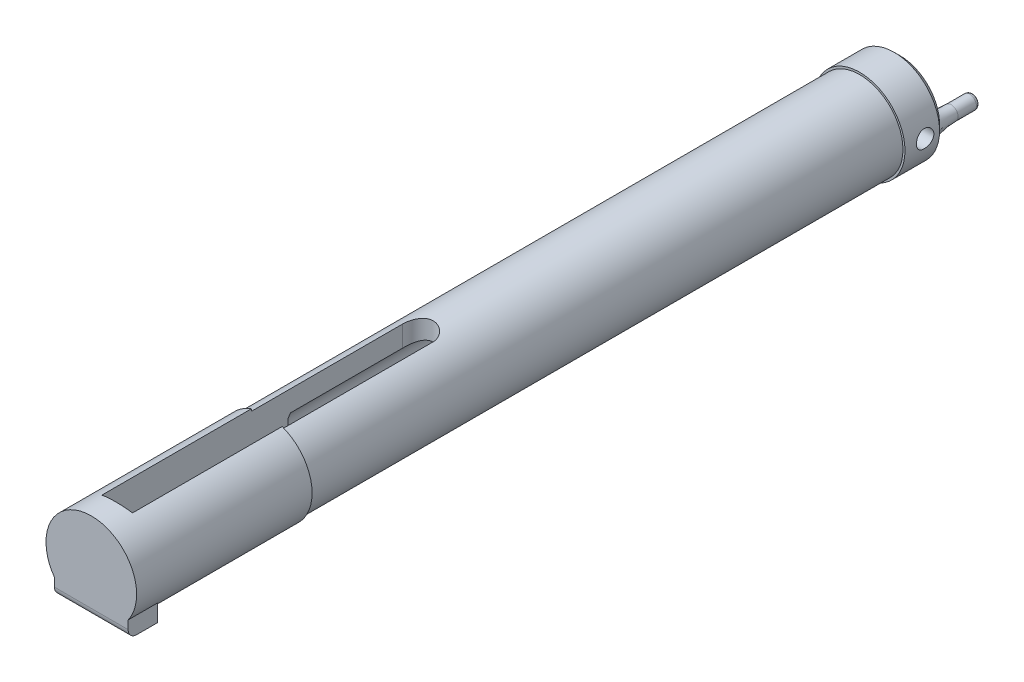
ISO-10303-21;
HEADER;
FILE_DESCRIPTION(('STEP AP214'),'2;1');
FILE_NAME('part.step','',(''),(''),'','','');
FILE_SCHEMA(('AUTOMOTIVE_DESIGN { 1 0 10303 214 1 1 1 1 }'));
ENDSEC;
DATA;
#1=APPLICATION_CONTEXT('core data for automotive mechanical design processes');
#2=APPLICATION_PROTOCOL_DEFINITION('international standard','automotive_design',2000,#1);
#3=PRODUCT_CONTEXT('',#1,'mechanical');
#4=PRODUCT('Part','Part','',(#3));
#5=PRODUCT_RELATED_PRODUCT_CATEGORY('part','',(#4));
#6=PRODUCT_DEFINITION_FORMATION('','',#4);
#7=PRODUCT_DEFINITION_CONTEXT('part definition',#1,'design');
#8=PRODUCT_DEFINITION('design','',#6,#7);
#9=PRODUCT_DEFINITION_SHAPE('','',#8);
#10=(LENGTH_UNIT() NAMED_UNIT(*) SI_UNIT(.MILLI.,.METRE.));
#11=(NAMED_UNIT(*) PLANE_ANGLE_UNIT() SI_UNIT($,.RADIAN.));
#12=(NAMED_UNIT(*) SI_UNIT($,.STERADIAN.) SOLID_ANGLE_UNIT());
#13=UNCERTAINTY_MEASURE_WITH_UNIT(LENGTH_MEASURE(1.E-05),#10,'distance_accuracy_value','');
#14=(GEOMETRIC_REPRESENTATION_CONTEXT(3) GLOBAL_UNCERTAINTY_ASSIGNED_CONTEXT((#13)) GLOBAL_UNIT_ASSIGNED_CONTEXT((#10,
#11,#12)) REPRESENTATION_CONTEXT('',''));
#15=CARTESIAN_POINT('',(0.,0.,0.));
#16=DIRECTION('',(0.,0.,1.));
#17=DIRECTION('',(1.,0.,0.));
#18=AXIS2_PLACEMENT_3D('',#15,#16,#17);
#19=CARTESIAN_POINT('',(0.,-4.8895,-0.508));
#20=DIRECTION('',(0.,0.,1.));
#21=DIRECTION('',(1.,0.,0.));
#22=AXIS2_PLACEMENT_3D('',#19,#20,#21);
#23=TOROIDAL_SURFACE('',#22,3.37142837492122,0.508);
#24=CARTESIAN_POINT('',(0.,-4.8895,-0.23495));
#25=DIRECTION('',(0.,0.,1.));
#26=DIRECTION('',(1.,0.,0.));
#27=AXIS2_PLACEMENT_3D('',#24,#25,#26);
#28=CIRCLE('',#27,2.94305039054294);
#29=CARTESIAN_POINT('',(2.86762881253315,-5.55150498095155,-0.234949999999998));
#30=VERTEX_POINT('',#29);
#31=CARTESIAN_POINT('',(2.03291050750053,-2.761397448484,-0.23495));
#32=VERTEX_POINT('',#31);
#33=EDGE_CURVE('E251',#30,#32,#28,.T.);
#34=ORIENTED_EDGE('',*,*,#33,.T.);
#35=CARTESIAN_POINT('',(2.03280633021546,-2.76147413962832,-0.235150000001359));
#36=CARTESIAN_POINT('',(2.04542191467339,-2.75218877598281,-0.210881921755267));
#37=CARTESIAN_POINT('',(2.05965173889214,-2.74157985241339,-0.18797381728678));
#38=CARTESIAN_POINT('',(2.0907465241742,-2.71794011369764,-0.145445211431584));
#39=CARTESIAN_POINT('',(2.1076103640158,-2.70491032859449,-0.125823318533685));
#40=CARTESIAN_POINT('',(2.14339814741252,-2.67664062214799,-0.0904067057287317));
#41=CARTESIAN_POINT('',(2.16232284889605,-2.66139988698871,-0.0746134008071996));
#42=CARTESIAN_POINT('',(2.20157748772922,-2.62901955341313,-0.0473138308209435));
#43=CARTESIAN_POINT('',(2.22190702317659,-2.61188049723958,-0.0358063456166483));
#44=CARTESIAN_POINT('',(2.26325941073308,-2.57612933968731,-0.0174448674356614));
#45=CARTESIAN_POINT('',(2.28428037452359,-2.55752108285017,-0.0105791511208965));
#46=CARTESIAN_POINT('',(2.32640511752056,-2.51926365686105,-0.00167519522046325));
#47=CARTESIAN_POINT('',(2.34750890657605,-2.49961436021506,0.000362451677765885));
#48=CARTESIAN_POINT('',(2.38888502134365,-2.46009699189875,-0.000462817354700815));
#49=CARTESIAN_POINT('',(2.40916462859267,-2.44023518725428,-0.0032616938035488));
#50=CARTESIAN_POINT('',(2.4486192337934,-2.40064282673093,-0.0135621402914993));
#51=CARTESIAN_POINT('',(2.46779447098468,-2.38091224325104,-0.0210626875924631));
#52=CARTESIAN_POINT('',(2.50447168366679,-2.34229993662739,-0.0405017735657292));
#53=CARTESIAN_POINT('',(2.52198126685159,-2.32341458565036,-0.0524187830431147));
#54=CARTESIAN_POINT('',(2.55504338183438,-2.28700673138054,-0.0803580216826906));
#55=CARTESIAN_POINT('',(2.5705954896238,-2.26948452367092,-0.0963811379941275));
#56=CARTESIAN_POINT('',(2.59882895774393,-2.23709018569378,-0.13134875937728));
#57=CARTESIAN_POINT('',(2.61160206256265,-2.22213871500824,-0.1501460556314));
#58=CARTESIAN_POINT('',(2.6348573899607,-2.1945146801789,-0.190614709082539));
#59=CARTESIAN_POINT('',(2.64533942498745,-2.18184230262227,-0.212286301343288));
#60=CARTESIAN_POINT('',(2.65457673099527,-2.17054448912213,-0.235150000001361));
#61=B_SPLINE_CURVE_WITH_KNOTS('',3,(#35,#36,#37,#38,#39,#40,#41,#42,#43,#44,#45,#46,#47,#48,#49,
#50,#51,#52,#53,#54,#55,#56,#57,#58,#59,#60),.UNSPECIFIED.,.F.,.F.,(4,2,2,2,2,2,2,2,2,2,2,2,4),
(0.,0.0865337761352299,0.173030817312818,0.25955977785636,0.346064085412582,0.432349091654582,
0.518644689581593,0.603806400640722,0.688949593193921,0.77368307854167,0.858434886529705,
0.939701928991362,1.0209756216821),.UNSPECIFIED.);
#62=CARTESIAN_POINT('',(2.36302342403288,-2.48478596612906,0.));
#63=VERTEX_POINT('',#62);
#64=EDGE_CURVE('E244',#32,#63,#61,.T.);
#65=ORIENTED_EDGE('',*,*,#64,.T.);
#66=CARTESIAN_POINT('',(0.,-4.8895,0.));
#67=DIRECTION('',(0.,0.,1.));
#68=DIRECTION('',(1.,0.,0.));
#69=AXIS2_PLACEMENT_3D('',#66,#67,#68);
#70=CIRCLE('',#69,3.37142837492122);
#71=CARTESIAN_POINT('',(3.32382849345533,-4.32497060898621,0.));
#72=VERTEX_POINT('',#71);
#73=EDGE_CURVE('E247',#72,#63,#70,.T.);
#74=ORIENTED_EDGE('',*,*,#73,.F.);
#75=CARTESIAN_POINT('',(3.34932846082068,-5.2748934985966,0.));
#76=VERTEX_POINT('',#75);
#77=EDGE_CURVE('E269',#76,#72,#70,.T.);
#78=ORIENTED_EDGE('',*,*,#77,.F.);
#79=CARTESIAN_POINT('',(2.86748033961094,-5.55158167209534,-0.23515));
#80=CARTESIAN_POINT('',(2.88733005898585,-5.54133751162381,-0.208442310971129));
#81=CARTESIAN_POINT('',(2.90937564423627,-5.52980850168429,-0.184071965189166));
#82=CARTESIAN_POINT('',(2.95651234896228,-5.50474490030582,-0.1401420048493));
#83=CARTESIAN_POINT('',(2.98157782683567,-5.49122700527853,-0.120545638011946));
#84=CARTESIAN_POINT('',(3.03361175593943,-5.4626537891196,-0.0859751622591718));
#85=CARTESIAN_POINT('',(3.0605685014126,-5.44760770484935,-0.070975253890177));
#86=CARTESIAN_POINT('',(3.11585329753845,-5.41617727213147,-0.0452637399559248));
#87=CARTESIAN_POINT('',(3.14418599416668,-5.39978823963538,-0.0345679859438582));
#88=CARTESIAN_POINT('',(3.20569621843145,-5.36353035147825,-0.0161878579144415));
#89=CARTESIAN_POINT('',(3.23897837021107,-5.34350232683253,-0.00916895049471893));
#90=CARTESIAN_POINT('',(3.3054842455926,-5.30262461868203,-0.000690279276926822));
#91=CARTESIAN_POINT('',(3.33870721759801,-5.28178028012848,0.000800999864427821));
#92=CARTESIAN_POINT('',(3.37162837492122,-5.2606677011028,-0.000416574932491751));
#93=B_SPLINE_CURVE_WITH_KNOTS('',3,(#79,#80,#81,#82,#83,#84,#85,#86,#87,#88,#89,#90,#91,#92),
.UNSPECIFIED.,.F.,.F.,(4,2,2,2,2,2,4),(0.,0.104049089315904,0.207269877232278,0.309900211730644,
0.412905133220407,0.530912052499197,0.648245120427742),.UNSPECIFIED.);
#94=EDGE_CURVE('E12',#30,#76,#93,.T.);
#95=ORIENTED_EDGE('',*,*,#94,.F.);
#96=EDGE_LOOP('',(#34,#65,#74,#78,#95));
#97=FACE_BOUND('',#96,.T.);
#98=ADVANCED_FACE('F41',(#97),#23,.F.);
#99=CARTESIAN_POINT('',(0.,-4.8895,3.89040530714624));
#100=DIRECTION('',(0.,0.,1.));
#101=DIRECTION('',(1.,0.,0.));
#102=AXIS2_PLACEMENT_3D('',#99,#100,#101);
#103=CYLINDRICAL_SURFACE('',#102,3.37142837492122);
#104=DIRECTION('',(0.,0.,1.));
#105=VECTOR('',#104,1.);
#106=CARTESIAN_POINT('',(-3.34932846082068,-5.2748934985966,-2.339975));
#107=LINE('',#106,#105);
#108=CARTESIAN_POINT('',(-3.34932846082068,-5.2748934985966,0.793749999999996));
#109=VERTEX_POINT('',#108);
#110=CARTESIAN_POINT('',(-3.34932846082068,-5.2748934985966,0.));
#111=VERTEX_POINT('',#110);
#112=EDGE_CURVE('E61',#109,#111,#107,.F.);
#113=ORIENTED_EDGE('',*,*,#112,.F.);
#114=CARTESIAN_POINT('',(-3.34929904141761,-5.27514908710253,0.793949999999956));
#115=CARTESIAN_POINT('',(-3.35865829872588,-5.19386835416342,0.730350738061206));
#116=CARTESIAN_POINT('',(-3.36498844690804,-5.11285515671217,0.665984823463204));
#117=CARTESIAN_POINT('',(-3.37180808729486,-4.95195890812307,0.536069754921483));
#118=CARTESIAN_POINT('',(-3.37231613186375,-4.87207307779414,0.470525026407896));
#119=CARTESIAN_POINT('',(-3.36776597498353,-4.713509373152,0.338199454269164));
#120=CARTESIAN_POINT('',(-3.36270813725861,-4.63483142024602,0.271418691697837));
#121=CARTESIAN_POINT('',(-3.34723156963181,-4.47871659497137,0.136526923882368));
#122=CARTESIAN_POINT('',(-3.33679575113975,-4.40128449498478,0.0684123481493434));
#123=CARTESIAN_POINT('',(-3.32379059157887,-4.32474749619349,-0.000200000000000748));
#124=B_SPLINE_CURVE_WITH_KNOTS('',3,(#114,#115,#116,#117,#118,#119,#120,#121,#122,#123),
.UNSPECIFIED.,.F.,.F.,(4,2,2,2,4),(0.,0.310821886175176,0.620653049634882,0.93046396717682,
1.24126543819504),.UNSPECIFIED.);
#125=CARTESIAN_POINT('',(-3.32382849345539,-4.32497060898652,0.));
#126=VERTEX_POINT('',#125);
#127=EDGE_CURVE('E371',#109,#126,#124,.T.);
#128=ORIENTED_EDGE('',*,*,#127,.T.);
#129=EDGE_CURVE('E349',#126,#111,#70,.T.);
#130=ORIENTED_EDGE('',*,*,#129,.T.);
#131=EDGE_LOOP('',(#113,#128,#130));
#132=FACE_BOUND('',#131,.T.);
#133=ADVANCED_FACE('F325',(#132),#103,.T.);
#134=DIRECTION('',(0.,0.,1.));
#135=VECTOR('',#134,1.);
#136=CARTESIAN_POINT('',(3.34932846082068,-5.2748934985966,-2.339975));
#137=LINE('',#136,#135);
#138=CARTESIAN_POINT('',(3.34932846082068,-5.2748934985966,0.793749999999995));
#139=VERTEX_POINT('',#138);
#140=EDGE_CURVE('E352',#76,#139,#137,.T.);
#141=ORIENTED_EDGE('',*,*,#140,.F.);
#142=ORIENTED_EDGE('',*,*,#77,.T.);
#143=CARTESIAN_POINT('',(3.32379059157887,-4.32474749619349,-0.0002));
#144=CARTESIAN_POINT('',(3.33679575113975,-4.40128449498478,0.0684123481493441));
#145=CARTESIAN_POINT('',(3.34723156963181,-4.47871659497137,0.136526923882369));
#146=CARTESIAN_POINT('',(3.36270813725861,-4.63483142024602,0.271418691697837));
#147=CARTESIAN_POINT('',(3.36776597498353,-4.713509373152,0.338199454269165));
#148=CARTESIAN_POINT('',(3.37231613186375,-4.87207307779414,0.470525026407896));
#149=CARTESIAN_POINT('',(3.37180808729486,-4.95195890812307,0.536069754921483));
#150=CARTESIAN_POINT('',(3.36498844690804,-5.11285515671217,0.665984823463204));
#151=CARTESIAN_POINT('',(3.35865829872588,-5.19386835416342,0.730350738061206));
#152=CARTESIAN_POINT('',(3.34929904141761,-5.27514908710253,0.793949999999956));
#153=B_SPLINE_CURVE_WITH_KNOTS('',3,(#143,#144,#145,#146,#147,#148,#149,#150,#151,#152),
.UNSPECIFIED.,.F.,.F.,(4,2,2,2,4),(0.,0.310801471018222,0.62061238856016,0.930443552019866,
1.24126543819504),.UNSPECIFIED.);
#154=EDGE_CURVE('E364',#72,#139,#153,.T.);
#155=ORIENTED_EDGE('',*,*,#154,.T.);
#156=EDGE_LOOP('',(#141,#142,#155));
#157=FACE_BOUND('',#156,.T.);
#158=ADVANCED_FACE('F331',(#157),#103,.T.);
#159=CARTESIAN_POINT('',(0.,-4.8895,-7.0612));
#160=DIRECTION('',(0.,0.,1.));
#161=DIRECTION('',(1.,0.,0.));
#162=AXIS2_PLACEMENT_3D('',#159,#160,#161);
#163=TOROIDAL_SURFACE('',#162,13.6525,12.7);
#164=CARTESIAN_POINT('',(0.,-4.8895,-7.0612));
#165=DIRECTION('',(0.,0.,1.));
#166=DIRECTION('',(1.,0.,0.));
#167=AXIS2_PLACEMENT_3D('',#164,#165,#166);
#168=CIRCLE('',#167,0.9525);
#169=CARTESIAN_POINT('',(0.9525,-4.8895,-7.0612));
#170=VERTEX_POINT('',#169);
#171=EDGE_CURVE('E355',#170,#170,#168,.T.);
#172=ORIENTED_EDGE('',*,*,#171,.T.);
#173=EDGE_LOOP('',(#172));
#174=FACE_BOUND('',#173,.T.);
#175=CARTESIAN_POINT('',(-2.03291050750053,-2.761397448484,-0.23495));
#176=VERTEX_POINT('',#175);
#177=CARTESIAN_POINT('',(-2.86762881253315,-5.55150498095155,-0.234950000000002));
#178=VERTEX_POINT('',#177);
#179=EDGE_CURVE('E266',#176,#178,#28,.T.);
#180=ORIENTED_EDGE('',*,*,#179,.F.);
#181=CARTESIAN_POINT('',(-2.03301473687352,-2.76132071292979,-0.23475));
#182=CARTESIAN_POINT('',(-1.9797743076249,-2.80050566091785,-0.336873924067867));
#183=CARTESIAN_POINT('',(-1.92639217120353,-2.83744757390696,-0.439766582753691));
#184=CARTESIAN_POINT('',(-1.81948938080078,-2.9071616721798,-0.646854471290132));
#185=CARTESIAN_POINT('',(-1.76596876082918,-2.93993479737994,-0.751049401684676));
#186=CARTESIAN_POINT('',(-1.65891394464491,-3.00164264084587,-0.960545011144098));
#187=CARTESIAN_POINT('',(-1.60537974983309,-3.03057766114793,-1.06584560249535));
#188=CARTESIAN_POINT('',(-1.49828095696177,-3.08493165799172,-1.27733495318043));
#189=CARTESIAN_POINT('',(-1.444716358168,-3.1103505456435,-1.3835237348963));
#190=CARTESIAN_POINT('',(-1.3374675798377,-3.15795197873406,-1.59640644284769));
#191=CARTESIAN_POINT('',(-1.28378360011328,-3.18013809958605,-1.70309967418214));
#192=CARTESIAN_POINT('',(-1.17587510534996,-3.22159940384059,-1.91679396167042));
#193=CARTESIAN_POINT('',(-1.12165051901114,-3.24087419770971,-2.02379505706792));
#194=CARTESIAN_POINT('',(-1.01202339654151,-3.2767633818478,-2.23756073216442));
#195=CARTESIAN_POINT('',(-0.956621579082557,-3.29337934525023,-2.34432541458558));
#196=CARTESIAN_POINT('',(-0.843380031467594,-3.32418502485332,-2.55686263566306));
#197=CARTESIAN_POINT('',(-0.785541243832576,-3.33837566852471,-2.66263553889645));
#198=CARTESIAN_POINT('',(-0.676204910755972,-3.36204128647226,-2.85205292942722));
#199=CARTESIAN_POINT('',(-0.625555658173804,-3.37190140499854,-2.93612347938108));
#200=CARTESIAN_POINT('',(-0.544735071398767,-3.38556424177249,-3.05943060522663));
#201=CARTESIAN_POINT('',(-0.516929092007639,-3.38993792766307,-3.10014188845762));
#202=CARTESIAN_POINT('',(-0.458996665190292,-3.39826749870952,-3.17990720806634));
#203=CARTESIAN_POINT('',(-0.428872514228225,-3.40222378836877,-3.21896282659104));
#204=CARTESIAN_POINT('',(-0.364764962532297,-3.40969987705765,-3.2947661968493));
#205=CARTESIAN_POINT('',(-0.33073395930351,-3.41321288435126,-3.33147457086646));
#206=CARTESIAN_POINT('',(-0.257318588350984,-3.41952874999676,-3.39907698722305));
#207=CARTESIAN_POINT('',(-0.21798951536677,-3.42233818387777,-3.43002411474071));
#208=CARTESIAN_POINT('',(-0.157967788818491,-3.42540048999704,-3.46428268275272));
#209=CARTESIAN_POINT('',(-0.140450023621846,-3.42617016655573,-3.47296776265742));
#210=CARTESIAN_POINT('',(-0.104291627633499,-3.42746139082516,-3.48760452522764));
#211=CARTESIAN_POINT('',(-0.085652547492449,-3.42798327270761,-3.49355988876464));
#212=CARTESIAN_POINT('',(-0.0473462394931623,-3.42872696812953,-3.50206349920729));
#213=CARTESIAN_POINT('',(-0.0276695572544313,-3.42894521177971,-3.50457120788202));
#214=CARTESIAN_POINT('',(0.011797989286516,-3.42903642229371,-3.50561798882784));
#215=CARTESIAN_POINT('',(0.0315888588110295,-3.42890937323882,-3.50415687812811));
#216=CARTESIAN_POINT('',(0.0678581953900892,-3.42837001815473,-3.49798033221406));
#217=CARTESIAN_POINT('',(0.0844217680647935,-3.42799875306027,-3.49373332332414));
#218=CARTESIAN_POINT('',(0.116753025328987,-3.42704994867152,-3.48293483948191));
#219=CARTESIAN_POINT('',(0.132520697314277,-3.4264724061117,-3.47638332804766));
#220=CARTESIAN_POINT('',(0.175493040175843,-3.42461845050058,-3.45548994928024));
#221=CARTESIAN_POINT('',(0.201691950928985,-3.42315362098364,-3.43912134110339));
#222=CARTESIAN_POINT('',(0.25151409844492,-3.41985509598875,-3.40282723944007));
#223=CARTESIAN_POINT('',(0.275123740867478,-3.41801958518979,-3.38288429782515));
#224=CARTESIAN_POINT('',(0.333670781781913,-3.41291873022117,-3.32839864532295));
#225=CARTESIAN_POINT('',(0.367030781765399,-3.40945061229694,-3.29220708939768));
#226=CARTESIAN_POINT('',(0.430409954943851,-3.40202883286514,-3.21701973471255));
#227=CARTESIAN_POINT('',(0.460419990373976,-3.39807390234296,-3.17801672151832));
#228=CARTESIAN_POINT('',(0.518475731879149,-3.38970388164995,-3.09793943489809));
#229=CARTESIAN_POINT('',(0.546494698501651,-3.38528399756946,-3.05684642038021));
#230=CARTESIAN_POINT('',(0.600856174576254,-3.37605832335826,-2.97369854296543));
#231=CARTESIAN_POINT('',(0.627200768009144,-3.37125303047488,-2.9316449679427));
#232=CARTESIAN_POINT('',(0.687419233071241,-3.35957291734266,-2.83256685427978));
#233=CARTESIAN_POINT('',(0.72083230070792,-3.35254711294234,-2.77528124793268));
#234=CARTESIAN_POINT('',(0.786276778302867,-3.33780311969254,-2.66001103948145));
#235=CARTESIAN_POINT('',(0.818307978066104,-3.33008482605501,-2.6020263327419));
#236=CARTESIAN_POINT('',(0.913050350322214,-3.30585115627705,-2.4274223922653));
#237=CARTESIAN_POINT('',(0.974380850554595,-3.28826284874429,-2.31020391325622));
#238=CARTESIAN_POINT('',(1.09549830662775,-3.24991458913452,-2.07522693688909));
#239=CARTESIAN_POINT('',(1.155282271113,-3.22914895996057,-1.9574678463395));
#240=CARTESIAN_POINT('',(1.2741350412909,-3.18412598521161,-1.7222895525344));
#241=CARTESIAN_POINT('',(1.33320402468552,-3.15986952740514,-1.60487027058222));
#242=CARTESIAN_POINT('',(1.44576316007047,-3.10986258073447,-1.38144512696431));
#243=CARTESIAN_POINT('',(1.4992716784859,-3.08444909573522,-1.27537329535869));
#244=CARTESIAN_POINT('',(1.60625942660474,-3.03011062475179,-1.06411388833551));
#245=CARTESIAN_POINT('',(1.65973865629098,-3.0011856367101,-0.958926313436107));
#246=CARTESIAN_POINT('',(1.7666106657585,-2.93954616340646,-0.749798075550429));
#247=CARTESIAN_POINT('',(1.82000346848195,-2.90683658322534,-0.645855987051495));
#248=CARTESIAN_POINT('',(1.92664954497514,-2.83726954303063,-0.43927078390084));
#249=CARTESIAN_POINT('',(1.97990278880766,-2.80041125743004,-0.336627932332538));
#250=CARTESIAN_POINT('',(2.03301473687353,-2.76132071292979,-0.234750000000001));
#251=B_SPLINE_CURVE_WITH_KNOTS('',3,(#181,#182,#183,#184,#185,#186,#187,#188,#189,#190,#191,
#192,#193,#194,#195,#196,#197,#198,#199,#200,#201,#202,#203,#204,#205,#206,#207,#208,#209,#210,
#211,#212,#213,#214,#215,#216,#217,#218,#219,#220,#221,#222,#223,#224,#225,#226,#227,#228,#229,
#230,#231,#232,#233,#234,#235,#236,#237,#238,#239,#240,#241,#242,#243,#244,#245,#246,#247,#248,
#249,#250),.UNSPECIFIED.,.F.,.F.,(4,2,2,2,2,2,2,2,2,2,2,2,2,2,2,2,2,2,2,2,2,2,2,2,2,2,2,2,2,2,2,
2,2,2,4),(0.,0.364911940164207,0.729741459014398,1.09454225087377,1.45935226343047,
1.82375568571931,2.18820782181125,2.55244352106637,2.91653961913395,3.21227572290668,
3.36071412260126,3.50900732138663,3.65935096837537,3.80823215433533,3.86676068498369,
3.92521005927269,3.98434097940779,4.04347462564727,4.09458531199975,4.14569680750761,
4.23793362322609,4.3306336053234,4.47826267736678,4.62628507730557,4.77601981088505,
4.92556437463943,5.12559658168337,5.32565910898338,5.72596048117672,6.12698563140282,
6.52790897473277,6.89233612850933,7.25676349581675,7.62072372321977,7.98475650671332),.UNSPECIFIED.);
#252=EDGE_CURVE('E255',#176,#32,#251,.T.);
#253=ORIENTED_EDGE('',*,*,#252,.T.);
#254=ORIENTED_EDGE('',*,*,#33,.F.);
#255=CARTESIAN_POINT('',(-2.86777736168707,-5.55142824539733,-0.234749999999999));
#256=CARTESIAN_POINT('',(-2.78239890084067,-5.59552460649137,-0.349663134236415));
#257=CARTESIAN_POINT('',(-2.69746329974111,-5.63691484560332,-0.465920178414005));
#258=CARTESIAN_POINT('',(-2.52861921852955,-5.7146520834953,-0.700819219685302));
#259=CARTESIAN_POINT('',(-2.44471060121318,-5.7509997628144,-0.819460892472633));
#260=CARTESIAN_POINT('',(-2.27795606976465,-5.81906634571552,-1.05897628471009));
#261=CARTESIAN_POINT('',(-2.19511129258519,-5.85078062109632,-1.17985210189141));
#262=CARTESIAN_POINT('',(-2.03052033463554,-5.90991866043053,-1.42336152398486));
#263=CARTESIAN_POINT('',(-1.94877403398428,-5.93734289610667,-1.54599493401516));
#264=CARTESIAN_POINT('',(-1.77354578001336,-5.99222207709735,-1.81166718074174));
#265=CARTESIAN_POINT('',(-1.68020242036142,-6.01902686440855,-1.95493078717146));
#266=CARTESIAN_POINT('',(-1.49367794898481,-6.06801138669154,-2.24248007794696));
#267=CARTESIAN_POINT('',(-1.40049698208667,-6.09018810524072,-2.38676636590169));
#268=CARTESIAN_POINT('',(-1.25954856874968,-6.12032063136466,-2.60255092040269));
#269=CARTESIAN_POINT('',(-1.21244035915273,-6.12983091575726,-2.67426570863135));
#270=CARTESIAN_POINT('',(-1.11734807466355,-6.14787636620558,-2.81723425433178));
#271=CARTESIAN_POINT('',(-1.06936405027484,-6.15641158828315,-2.88848803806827));
#272=CARTESIAN_POINT('',(-0.971941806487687,-6.17254135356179,-3.02998667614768));
#273=CARTESIAN_POINT('',(-0.922505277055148,-6.18013694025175,-3.1002325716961));
#274=CARTESIAN_POINT('',(-0.821157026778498,-6.19441969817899,-3.23900011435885));
#275=CARTESIAN_POINT('',(-0.769246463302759,-6.20110728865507,-3.30752254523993));
#276=CARTESIAN_POINT('',(-0.68832322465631,-6.21043001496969,-3.40773135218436));
#277=CARTESIAN_POINT('',(-0.660887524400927,-6.21341509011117,-3.44065238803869));
#278=CARTESIAN_POINT('',(-0.604617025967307,-6.21914331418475,-3.5053447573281));
#279=CARTESIAN_POINT('',(-0.575781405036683,-6.22188631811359,-3.53711539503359));
#280=CARTESIAN_POINT('',(-0.516630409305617,-6.22707535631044,-3.59860236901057));
#281=CARTESIAN_POINT('',(-0.486335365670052,-6.22952438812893,-3.62833781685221));
#282=CARTESIAN_POINT('',(-0.423438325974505,-6.23411561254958,-3.68526478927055));
#283=CARTESIAN_POINT('',(-0.390839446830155,-6.23625820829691,-3.71245963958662));
#284=CARTESIAN_POINT('',(-0.330799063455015,-6.23969130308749,-3.75683438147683));
#285=CARTESIAN_POINT('',(-0.303991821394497,-6.24106298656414,-3.7748530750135));
#286=CARTESIAN_POINT('',(-0.248353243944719,-6.24352451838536,-3.80756730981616));
#287=CARTESIAN_POINT('',(-0.219521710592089,-6.24461433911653,-3.8222625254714));
#288=CARTESIAN_POINT('',(-0.159324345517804,-6.24644190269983,-3.84710603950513));
#289=CARTESIAN_POINT('',(-0.127925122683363,-6.24717367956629,-3.85717712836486));
#290=CARTESIAN_POINT('',(-0.0637296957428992,-6.24815659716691,-3.87074379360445));
#291=CARTESIAN_POINT('',(-0.0309371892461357,-6.24840893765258,-3.87425578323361));
#292=CARTESIAN_POINT('',(0.0298515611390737,-6.24839185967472,-3.87402023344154));
#293=CARTESIAN_POINT('',(0.0578552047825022,-6.24819265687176,-3.87124962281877));
#294=CARTESIAN_POINT('',(0.112927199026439,-6.24744032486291,-3.86085251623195));
#295=CARTESIAN_POINT('',(0.13999474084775,-6.24688689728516,-3.85322192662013));
#296=CARTESIAN_POINT('',(0.203376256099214,-6.24519952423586,-3.83017606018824));
#297=CARTESIAN_POINT('',(0.238977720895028,-6.24392106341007,-3.81285739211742));
#298=CARTESIAN_POINT('',(0.307238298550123,-6.24093609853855,-3.77314843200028));
#299=CARTESIAN_POINT('',(0.339884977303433,-6.23922789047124,-3.75073798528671));
#300=CARTESIAN_POINT('',(0.418015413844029,-6.23457820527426,-3.6909796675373));
#301=CARTESIAN_POINT('',(0.461969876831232,-6.23144213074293,-3.65168624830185));
#302=CARTESIAN_POINT('',(0.546095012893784,-6.22463331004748,-3.56923455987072));
#303=CARTESIAN_POINT('',(0.586255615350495,-6.22095919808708,-3.52606656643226));
#304=CARTESIAN_POINT('',(0.664430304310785,-6.21309867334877,-3.4369009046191));
#305=CARTESIAN_POINT('',(0.702409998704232,-6.20890626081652,-3.39087390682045));
#306=CARTESIAN_POINT('',(0.776441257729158,-6.20008278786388,-3.29744450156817));
#307=CARTESIAN_POINT('',(0.812495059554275,-6.19545225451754,-3.25004379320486));
#308=CARTESIAN_POINT('',(0.895291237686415,-6.18411253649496,-3.13810431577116));
#309=CARTESIAN_POINT('',(0.941515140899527,-6.17723072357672,-3.07320151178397));
#310=CARTESIAN_POINT('',(1.03251074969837,-6.16267332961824,-2.94246932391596));
#311=CARTESIAN_POINT('',(1.07728223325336,-6.15499762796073,-2.87663980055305));
#312=CARTESIAN_POINT('',(1.16595092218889,-6.13881851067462,-2.74445502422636));
#313=CARTESIAN_POINT('',(1.20984773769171,-6.13031473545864,-2.67809955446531));
#314=CARTESIAN_POINT('',(1.29712901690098,-6.11244140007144,-2.54516800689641));
#315=CARTESIAN_POINT('',(1.3405134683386,-6.10307181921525,-2.47859192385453));
#316=CARTESIAN_POINT('',(1.47043166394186,-6.07356955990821,-2.27866188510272));
#317=CARTESIAN_POINT('',(1.55661593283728,-6.05206427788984,-2.14528009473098));
#318=CARTESIAN_POINT('',(1.72934821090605,-6.00498552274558,-1.87951469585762));
#319=CARTESIAN_POINT('',(1.8158961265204,-5.97941304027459,-1.74713085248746));
#320=CARTESIAN_POINT('',(1.9813797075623,-5.92650099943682,-1.49701346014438));
#321=CARTESIAN_POINT('',(2.0602203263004,-5.89958730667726,-1.37912751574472));
#322=CARTESIAN_POINT('',(2.2189239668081,-5.84174713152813,-1.14503472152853));
#323=CARTESIAN_POINT('',(2.29878698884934,-5.81082064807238,-1.02882787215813));
#324=CARTESIAN_POINT('',(2.45962408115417,-5.74459082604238,-0.798324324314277));
#325=CARTESIAN_POINT('',(2.54059882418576,-5.70928472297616,-0.684028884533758));
#326=CARTESIAN_POINT('',(2.70350506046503,-5.63396810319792,-0.457655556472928));
#327=CARTESIAN_POINT('',(2.7854367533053,-5.59395658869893,-0.345578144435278));
#328=CARTESIAN_POINT('',(2.86777736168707,-5.55142824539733,-0.234749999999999));
#329=B_SPLINE_CURVE_WITH_KNOTS('',3,(#255,#256,#257,#258,#259,#260,#261,#262,#263,#264,#265,
#266,#267,#268,#269,#270,#271,#272,#273,#274,#275,#276,#277,#278,#279,#280,#281,#282,#283,#284,
#285,#286,#287,#288,#289,#290,#291,#292,#293,#294,#295,#296,#297,#298,#299,#300,#301,#302,#303,
#304,#305,#306,#307,#308,#309,#310,#311,#312,#313,#314,#315,#316,#317,#318,#319,#320,#321,#322,
#323,#324,#325,#326,#327,#328),.UNSPECIFIED.,.F.,.F.,(4,2,2,2,2,2,2,2,2,2,2,2,2,2,2,2,2,2,2,2,2,
2,2,2,2,2,2,2,2,2,2,2,2,2,2,2,4),(0.,0.449332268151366,0.898603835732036,1.34832114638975,
1.79798897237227,2.31714534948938,2.83663904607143,3.09561860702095,3.35458328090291,
3.61325773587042,3.87181234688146,4.0006606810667,4.12958568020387,4.25705818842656,
4.38436142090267,4.48118072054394,4.5780095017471,4.67640098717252,4.77454592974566,
4.85848915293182,4.94250317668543,5.06065890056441,5.17929072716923,5.35593426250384,
5.53303423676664,5.71241985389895,5.89159234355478,6.1314855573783,6.37141527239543,
6.61144964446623,6.8514897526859,7.332197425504,7.81278819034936,8.24578012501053,
8.67877217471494,9.11203894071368,9.54539774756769),.UNSPECIFIED.);
#330=EDGE_CURVE('E392',#178,#30,#329,.T.);
#331=ORIENTED_EDGE('',*,*,#330,.F.);
#332=EDGE_LOOP('',(#180,#253,#254,#331));
#333=FACE_BOUND('',#332,.T.);
#334=ADVANCED_FACE('F337',(#174,#333),#163,.F.);
#335=CARTESIAN_POINT('',(-2.36302342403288,-2.48478596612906,0.));
#336=VERTEX_POINT('',#335);
#337=EDGE_CURVE('E267',#336,#126,#70,.T.);
#338=ORIENTED_EDGE('',*,*,#337,.F.);
#339=CARTESIAN_POINT('',(-2.65457673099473,-2.1705444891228,-0.235150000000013));
#340=CARTESIAN_POINT('',(-2.64484017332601,-2.18245353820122,-0.211042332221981));
#341=CARTESIAN_POINT('',(-2.63371615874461,-2.19589431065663,-0.188261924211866));
#342=CARTESIAN_POINT('',(-2.6089370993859,-2.22527644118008,-0.14593364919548));
#343=CARTESIAN_POINT('',(-2.59528312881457,-2.2412167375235,-0.126384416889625));
#344=CARTESIAN_POINT('',(-2.56567129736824,-2.27505533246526,-0.0910654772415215));
#345=CARTESIAN_POINT('',(-2.54971218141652,-2.2929546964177,-0.075297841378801));
#346=CARTESIAN_POINT('',(-2.51583528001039,-2.33007384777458,-0.0480076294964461));
#347=CARTESIAN_POINT('',(-2.4979181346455,-2.34929320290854,-0.0364836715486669));
#348=CARTESIAN_POINT('',(-2.46061766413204,-2.38833138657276,-0.0180510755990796));
#349=CARTESIAN_POINT('',(-2.44124098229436,-2.40814727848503,-0.011122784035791));
#350=CARTESIAN_POINT('',(-2.40144730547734,-2.44783193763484,-0.0020013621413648));
#351=CARTESIAN_POINT('',(-2.38103013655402,-2.46770071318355,0.000190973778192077));
#352=CARTESIAN_POINT('',(-2.33986508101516,-2.50676532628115,-0.000215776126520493));
#353=CARTESIAN_POINT('',(-2.31912025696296,-2.52596473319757,-0.00278340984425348));
#354=CARTESIAN_POINT('',(-2.2777799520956,-2.56330559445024,-0.0125574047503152));
#355=CARTESIAN_POINT('',(-2.25718444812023,-2.58144721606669,-0.0197630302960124));
#356=CARTESIAN_POINT('',(-2.216672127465,-2.61631878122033,-0.0386346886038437));
#357=CARTESIAN_POINT('',(-2.19675896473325,-2.63304167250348,-0.0503215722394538));
#358=CARTESIAN_POINT('',(-2.15834051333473,-2.66462503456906,-0.0778150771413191));
#359=CARTESIAN_POINT('',(-2.13983558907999,-2.67948502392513,-0.093622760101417));
#360=CARTESIAN_POINT('',(-2.10509768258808,-2.70685933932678,-0.128675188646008));
#361=CARTESIAN_POINT('',(-2.08883642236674,-2.71940369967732,-0.147868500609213));
#362=CARTESIAN_POINT('',(-2.05881218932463,-2.74220549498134,-0.189330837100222));
#363=CARTESIAN_POINT('',(-2.04504992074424,-2.75246228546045,-0.211600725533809));
#364=CARTESIAN_POINT('',(-2.03280633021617,-2.7614741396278,-0.235150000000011));
#365=B_SPLINE_CURVE_WITH_KNOTS('',3,(#339,#340,#341,#342,#343,#344,#345,#346,#347,#348,#349,
#350,#351,#352,#353,#354,#355,#356,#357,#358,#359,#360,#361,#362,#363,#364),.UNSPECIFIED.,.F.,
.F.,(4,2,2,2,2,2,2,2,2,2,2,2,4),(0.,0.0856795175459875,0.171322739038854,0.257012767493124,
0.342674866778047,0.427968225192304,0.513275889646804,0.598021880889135,0.682754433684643,
0.767886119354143,0.853039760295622,0.936996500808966,1.02097686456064),.UNSPECIFIED.);
#366=EDGE_CURVE('E256',#336,#176,#365,.T.);
#367=ORIENTED_EDGE('',*,*,#366,.T.);
#368=ORIENTED_EDGE('',*,*,#179,.T.);
#369=CARTESIAN_POINT('',(-3.37162837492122,-5.2606677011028,-0.00041657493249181));
#370=CARTESIAN_POINT('',(-3.3356825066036,-5.28372409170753,0.000907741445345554));
#371=CARTESIAN_POINT('',(-3.29937568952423,-5.30645592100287,-0.000990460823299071));
#372=CARTESIAN_POINT('',(-3.22651341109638,-5.35106633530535,-0.0113856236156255));
#373=CARTESIAN_POINT('',(-3.1899610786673,-5.37292952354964,-0.0199701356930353));
#374=CARTESIAN_POINT('',(-3.11536042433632,-5.4165534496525,-0.0448427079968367));
#375=CARTESIAN_POINT('',(-3.07740935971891,-5.43818026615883,-0.0616663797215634));
#376=CARTESIAN_POINT('',(-3.00485651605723,-5.47859821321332,-0.103372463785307));
#377=CARTESIAN_POINT('',(-2.97023066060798,-5.4974103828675,-0.128190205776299));
#378=CARTESIAN_POINT('',(-2.9255514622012,-5.52121980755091,-0.168752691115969));
#379=CARTESIAN_POINT('',(-2.9131613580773,-5.52776383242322,-0.181078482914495));
#380=CARTESIAN_POINT('',(-2.88945360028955,-5.54019306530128,-0.207094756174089));
#381=CARTESIAN_POINT('',(-2.87813909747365,-5.54607634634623,-0.220789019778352));
#382=CARTESIAN_POINT('',(-2.86748033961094,-5.55158167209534,-0.235149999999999));
#383=B_SPLINE_CURVE_WITH_KNOTS('',3,(#369,#370,#371,#372,#373,#374,#375,#376,#377,#378,#379,
#380,#381,#382),.UNSPECIFIED.,.F.,.F.,(4,2,2,2,2,2,4),(0.,0.128099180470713,0.257904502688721,
0.397569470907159,0.536131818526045,0.592038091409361,0.648103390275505),.UNSPECIFIED.);
#384=EDGE_CURVE('E54',#111,#178,#383,.T.);
#385=ORIENTED_EDGE('',*,*,#384,.F.);
#386=ORIENTED_EDGE('',*,*,#129,.F.);
#387=EDGE_LOOP('',(#338,#367,#368,#385,#386));
#388=FACE_BOUND('',#387,.T.);
#389=ADVANCED_FACE('F326',(#388),#23,.F.);
#390=CARTESIAN_POINT('',(0.,0.,107.97410314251));
#391=DIRECTION('',(0.,0.,1.));
#392=DIRECTION('',(1.,0.,0.));
#393=AXIS2_PLACEMENT_3D('',#390,#391,#392);
#394=CYLINDRICAL_SURFACE('',#393,3.429);
#395=CARTESIAN_POINT('',(-2.12089999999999,-2.69440609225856,66.4845));
#396=CARTESIAN_POINT('',(-2.12091238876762,-2.69438189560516,66.4312591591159));
#397=CARTESIAN_POINT('',(-2.11889577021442,-2.69598349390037,66.3780327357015));
#398=CARTESIAN_POINT('',(-2.11090332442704,-2.70225358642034,66.2721148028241));
#399=CARTESIAN_POINT('',(-2.10493170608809,-2.70691882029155,66.2194227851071));
#400=CARTESIAN_POINT('',(-2.08919475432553,-2.71908038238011,66.1154079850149));
#401=CARTESIAN_POINT('',(-2.07946204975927,-2.72655234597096,66.0640773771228));
#402=CARTESIAN_POINT('',(-2.05636334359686,-2.74401547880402,65.9626829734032));
#403=CARTESIAN_POINT('',(-2.04299653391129,-2.75400720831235,65.9126194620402));
#404=CARTESIAN_POINT('',(-1.99783057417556,-2.78713229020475,65.7651879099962));
#405=CARTESIAN_POINT('',(-1.96088611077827,-2.81348138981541,65.6700678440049));
#406=CARTESIAN_POINT('',(-1.87459520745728,-2.87169644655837,65.4873167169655));
#407=CARTESIAN_POINT('',(-1.82521875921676,-2.90357569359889,65.3997044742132));
#408=CARTESIAN_POINT('',(-1.70801578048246,-2.97422029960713,65.2221083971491));
#409=CARTESIAN_POINT('',(-1.63862557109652,-3.01334218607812,65.1332955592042));
#410=CARTESIAN_POINT('',(-1.48658760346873,-3.09118126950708,64.9676197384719));
#411=CARTESIAN_POINT('',(-1.40393488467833,-3.12989830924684,64.8907612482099));
#412=CARTESIAN_POINT('',(-1.21593789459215,-3.20796844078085,64.7421770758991));
#413=CARTESIAN_POINT('',(-1.10906857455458,-3.24686195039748,64.6721150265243));
#414=CARTESIAN_POINT('',(-0.882188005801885,-3.31568795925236,64.5515192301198));
#415=CARTESIAN_POINT('',(-0.762188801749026,-3.34562857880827,64.500967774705));
#416=CARTESIAN_POINT('',(-0.525135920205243,-3.39047711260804,64.4262709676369));
#417=CARTESIAN_POINT('',(-0.408989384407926,-3.4065896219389,64.3999892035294));
#418=CARTESIAN_POINT('',(-0.172940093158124,-3.42667622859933,64.3673176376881));
#419=CARTESIAN_POINT('',(-0.0530412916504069,-3.43066269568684,64.3609075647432));
#420=CARTESIAN_POINT('',(0.170072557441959,-3.42635579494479,64.3678790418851));
#421=CARTESIAN_POINT('',(0.273407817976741,-3.41960857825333,64.3787683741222));
#422=CARTESIAN_POINT('',(0.476449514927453,-3.39727325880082,64.4152368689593));
#423=CARTESIAN_POINT('',(0.57615567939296,-3.38168449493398,64.4408171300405));
#424=CARTESIAN_POINT('',(0.769822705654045,-3.34293492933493,64.5055954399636));
#425=CARTESIAN_POINT('',(0.86376236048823,-3.31974795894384,64.5448405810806));
#426=CARTESIAN_POINT('',(1.04380340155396,-3.26761546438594,64.6354841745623));
#427=CARTESIAN_POINT('',(1.12990329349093,-3.23866884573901,64.6868849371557));
#428=CARTESIAN_POINT('',(1.30319256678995,-3.17322033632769,64.8074837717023));
#429=CARTESIAN_POINT('',(1.38921229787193,-3.13622705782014,64.8780935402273));
#430=CARTESIAN_POINT('',(1.54895949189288,-3.06049066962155,65.0314924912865));
#431=CARTESIAN_POINT('',(1.62266500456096,-3.02174458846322,65.1143029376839));
#432=CARTESIAN_POINT('',(1.76519421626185,-2.94102882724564,65.3021528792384));
#433=CARTESIAN_POINT('',(1.8321941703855,-2.8992788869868,65.4086805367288));
#434=CARTESIAN_POINT('',(1.94693973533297,-2.82350983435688,65.6339199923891));
#435=CARTESIAN_POINT('',(1.99475644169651,-2.78946238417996,65.7525847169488));
#436=CARTESIAN_POINT('',(2.04620014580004,-2.75162248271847,65.9242800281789));
#437=CARTESIAN_POINT('',(2.05902743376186,-2.74201386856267,65.9734012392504));
#438=CARTESIAN_POINT('',(2.08118666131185,-2.72523326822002,66.0728341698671));
#439=CARTESIAN_POINT('',(2.09051987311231,-2.71806039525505,66.1231454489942));
#440=CARTESIAN_POINT('',(2.10560346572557,-2.70639469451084,66.2250355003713));
#441=CARTESIAN_POINT('',(2.11132409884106,-2.70192413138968,66.2766212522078));
#442=CARTESIAN_POINT('',(2.11898015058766,-2.69591709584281,66.3802998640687));
#443=CARTESIAN_POINT('',(2.12091124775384,-2.69438397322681,66.4323932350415));
#444=CARTESIAN_POINT('',(2.12090000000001,-2.69440609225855,66.4845));
#445=B_SPLINE_CURVE_WITH_KNOTS('',3,(#395,#396,#397,#398,#399,#400,#401,#402,#403,#404,#405,
#406,#407,#408,#409,#410,#411,#412,#413,#414,#415,#416,#417,#418,#419,#420,#421,#422,#423,#424,
#425,#426,#427,#428,#429,#430,#431,#432,#433,#434,#435,#436,#437,#438,#439,#440,#441,#442,#443,
#444),.UNSPECIFIED.,.F.,.F.,(4,2,2,2,2,2,2,2,2,2,2,2,2,2,2,2,2,2,2,2,2,2,2,2,4),(0.,
0.159636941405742,0.319104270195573,0.477218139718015,0.635367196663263,0.950121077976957,
1.26564212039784,1.62216011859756,1.97881177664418,2.37736078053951,2.77554719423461,
3.13388278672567,3.49185271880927,3.80274043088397,4.11365139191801,4.42564460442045,
4.73769716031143,5.08814851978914,5.4392180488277,5.83509545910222,6.22949183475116,
6.38435189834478,6.53915552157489,6.69521779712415,6.85145793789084),.UNSPECIFIED.);
#446=CARTESIAN_POINT('',(-2.12089999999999,-2.69440609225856,66.4845));
#447=VERTEX_POINT('',#446);
#448=CARTESIAN_POINT('',(2.12090000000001,-2.69440609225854,66.4845));
#449=VERTEX_POINT('',#448);
#450=EDGE_CURVE('E457',#447,#449,#445,.T.);
#451=ORIENTED_EDGE('',*,*,#450,.T.);
#452=DIRECTION('',(0.,0.,1.));
#453=VECTOR('',#452,1.);
#454=CARTESIAN_POINT('',(2.12090000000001,-2.69440609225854,107.97410314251));
#455=LINE('',#454,#453);
#456=CARTESIAN_POINT('',(2.12090000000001,-2.69440609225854,81.899125));
#457=VERTEX_POINT('',#456);
#458=EDGE_CURVE('E697',#449,#457,#455,.T.);
#459=ORIENTED_EDGE('',*,*,#458,.T.);
#460=CARTESIAN_POINT('',(0.,0.,81.899125));
#461=DIRECTION('',(0.,0.,1.));
#462=DIRECTION('',(1.,0.,0.));
#463=AXIS2_PLACEMENT_3D('',#460,#461,#462);
#464=CIRCLE('',#463,3.429);
#465=CARTESIAN_POINT('',(2.12090000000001,2.69440609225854,81.899125));
#466=VERTEX_POINT('',#465);
#467=EDGE_CURVE('E274',#457,#466,#464,.T.);
#468=ORIENTED_EDGE('',*,*,#467,.T.);
#469=DIRECTION('',(0.,0.,1.));
#470=VECTOR('',#469,1.);
#471=CARTESIAN_POINT('',(2.12090000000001,2.69440609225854,107.97410314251));
#472=LINE('',#471,#470);
#473=CARTESIAN_POINT('',(2.12090000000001,2.69440609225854,66.4845));
#474=VERTEX_POINT('',#473);
#475=EDGE_CURVE('E745',#466,#474,#472,.F.);
#476=ORIENTED_EDGE('',*,*,#475,.T.);
#477=CARTESIAN_POINT('',(2.12090000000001,2.69440609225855,66.4845));
#478=CARTESIAN_POINT('',(2.12091238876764,2.69438189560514,66.4312591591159));
#479=CARTESIAN_POINT('',(2.11889577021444,2.69598349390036,66.3780327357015));
#480=CARTESIAN_POINT('',(2.11090332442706,2.70225358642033,66.2721148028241));
#481=CARTESIAN_POINT('',(2.1049317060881,2.70691882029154,66.2194227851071));
#482=CARTESIAN_POINT('',(2.08919475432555,2.7190803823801,66.1154079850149));
#483=CARTESIAN_POINT('',(2.07946204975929,2.72655234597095,66.0640773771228));
#484=CARTESIAN_POINT('',(2.05636334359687,2.74401547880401,65.9626829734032));
#485=CARTESIAN_POINT('',(2.04299653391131,2.75400720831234,65.9126194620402));
#486=CARTESIAN_POINT('',(1.99783057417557,2.78713229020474,65.7651879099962));
#487=CARTESIAN_POINT('',(1.96088611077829,2.8134813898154,65.6700678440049));
#488=CARTESIAN_POINT('',(1.8745952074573,2.87169644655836,65.4873167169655));
#489=CARTESIAN_POINT('',(1.82521875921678,2.90357569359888,65.3997044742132));
#490=CARTESIAN_POINT('',(1.70801578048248,2.97422029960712,65.2221083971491));
#491=CARTESIAN_POINT('',(1.63862557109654,3.01334218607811,65.1332955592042));
#492=CARTESIAN_POINT('',(1.48658760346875,3.09118126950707,64.9676197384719));
#493=CARTESIAN_POINT('',(1.40393488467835,3.12989830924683,64.8907612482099));
#494=CARTESIAN_POINT('',(1.21593789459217,3.20796844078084,64.7421770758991));
#495=CARTESIAN_POINT('',(1.1090685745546,3.24686195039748,64.6721150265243));
#496=CARTESIAN_POINT('',(0.882188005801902,3.31568795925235,64.5515192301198));
#497=CARTESIAN_POINT('',(0.762188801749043,3.34562857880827,64.500967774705));
#498=CARTESIAN_POINT('',(0.525135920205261,3.39047711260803,64.4262709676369));
#499=CARTESIAN_POINT('',(0.408989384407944,3.4065896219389,64.3999892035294));
#500=CARTESIAN_POINT('',(0.172940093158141,3.42667622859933,64.3673176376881));
#501=CARTESIAN_POINT('',(0.0530412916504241,3.43066269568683,64.3609075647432));
#502=CARTESIAN_POINT('',(-0.170072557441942,3.42635579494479,64.3678790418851));
#503=CARTESIAN_POINT('',(-0.273407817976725,3.41960857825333,64.3787683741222));
#504=CARTESIAN_POINT('',(-0.476449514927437,3.39727325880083,64.4152368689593));
#505=CARTESIAN_POINT('',(-0.576155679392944,3.38168449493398,64.4408171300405));
#506=CARTESIAN_POINT('',(-0.769822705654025,3.34293492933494,64.5055954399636));
#507=CARTESIAN_POINT('',(-0.863762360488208,3.31974795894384,64.5448405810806));
#508=CARTESIAN_POINT('',(-1.04380340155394,3.26761546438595,64.6354841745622));
#509=CARTESIAN_POINT('',(-1.12990329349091,3.23866884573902,64.6868849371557));
#510=CARTESIAN_POINT('',(-1.30319256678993,3.1732203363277,64.8074837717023));
#511=CARTESIAN_POINT('',(-1.38921229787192,3.13622705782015,64.8780935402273));
#512=CARTESIAN_POINT('',(-1.54895949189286,3.06049066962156,65.0314924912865));
#513=CARTESIAN_POINT('',(-1.62266500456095,3.02174458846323,65.1143029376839));
#514=CARTESIAN_POINT('',(-1.76519421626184,2.94102882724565,65.3021528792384));
#515=CARTESIAN_POINT('',(-1.83219417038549,2.89927888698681,65.4086805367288));
#516=CARTESIAN_POINT('',(-1.94693973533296,2.8235098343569,65.6339199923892));
#517=CARTESIAN_POINT('',(-1.99475644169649,2.78946238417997,65.7525847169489));
#518=CARTESIAN_POINT('',(-2.04620014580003,2.75162248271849,65.9242800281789));
#519=CARTESIAN_POINT('',(-2.05902743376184,2.74201386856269,65.9734012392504));
#520=CARTESIAN_POINT('',(-2.08118666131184,2.72523326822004,66.0728341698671));
#521=CARTESIAN_POINT('',(-2.09051987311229,2.71806039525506,66.1231454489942));
#522=CARTESIAN_POINT('',(-2.10560346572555,2.70639469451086,66.2250355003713));
#523=CARTESIAN_POINT('',(-2.11132409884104,2.70192413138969,66.2766212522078));
#524=CARTESIAN_POINT('',(-2.11898015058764,2.69591709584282,66.3802998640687));
#525=CARTESIAN_POINT('',(-2.12091124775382,2.69438397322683,66.4323932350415));
#526=CARTESIAN_POINT('',(-2.12089999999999,2.69440609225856,66.4845));
#527=B_SPLINE_CURVE_WITH_KNOTS('',3,(#477,#478,#479,#480,#481,#482,#483,#484,#485,#486,#487,
#488,#489,#490,#491,#492,#493,#494,#495,#496,#497,#498,#499,#500,#501,#502,#503,#504,#505,#506,
#507,#508,#509,#510,#511,#512,#513,#514,#515,#516,#517,#518,#519,#520,#521,#522,#523,#524,#525,
#526),.UNSPECIFIED.,.F.,.F.,(4,2,2,2,2,2,2,2,2,2,2,2,2,2,2,2,2,2,2,2,2,2,2,2,4),(0.,
0.159636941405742,0.319104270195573,0.477218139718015,0.635367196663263,0.950121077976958,
1.26564212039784,1.62216011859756,1.97881177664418,2.37736078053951,2.77554719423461,
3.13388278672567,3.49185271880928,3.80274043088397,4.11365139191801,4.42564460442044,
4.73769716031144,5.08814851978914,5.4392180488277,5.83509545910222,6.22949183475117,
6.38435189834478,6.53915552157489,6.69521779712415,6.85145793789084),.UNSPECIFIED.);
#528=CARTESIAN_POINT('',(-2.12089999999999,2.69440609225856,66.4845));
#529=VERTEX_POINT('',#528);
#530=EDGE_CURVE('E449',#474,#529,#527,.T.);
#531=ORIENTED_EDGE('',*,*,#530,.T.);
#532=DIRECTION('',(0.,0.,1.));
#533=VECTOR('',#532,1.);
#534=CARTESIAN_POINT('',(-2.12089999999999,2.69440609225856,107.97410314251));
#535=LINE('',#534,#533);
#536=CARTESIAN_POINT('',(-2.12089999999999,2.69440609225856,81.899125));
#537=VERTEX_POINT('',#536);
#538=EDGE_CURVE('E641',#529,#537,#535,.T.);
#539=ORIENTED_EDGE('',*,*,#538,.T.);
#540=CARTESIAN_POINT('',(-2.12089999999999,-2.69440609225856,81.899125));
#541=VERTEX_POINT('',#540);
#542=EDGE_CURVE('E277',#537,#541,#464,.T.);
#543=ORIENTED_EDGE('',*,*,#542,.T.);
#544=DIRECTION('',(0.,0.,1.));
#545=VECTOR('',#544,1.);
#546=CARTESIAN_POINT('',(-2.12089999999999,-2.69440609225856,107.97410314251));
#547=LINE('',#546,#545);
#548=EDGE_CURVE('E678',#541,#447,#547,.F.);
#549=ORIENTED_EDGE('',*,*,#548,.T.);
#550=EDGE_LOOP('',(#451,#459,#468,#476,#531,#539,#543,#549));
#551=FACE_BOUND('',#550,.T.);
#552=CARTESIAN_POINT('',(0.,0.,0.));
#553=DIRECTION('',(0.,0.,1.));
#554=DIRECTION('',(1.,0.,0.));
#555=AXIS2_PLACEMENT_3D('',#552,#553,#554);
#556=CIRCLE('',#555,3.429);
#557=EDGE_CURVE('E263',#63,#336,#556,.T.);
#558=ORIENTED_EDGE('',*,*,#557,.F.);
#559=ORIENTED_EDGE('',*,*,#64,.F.);
#560=ORIENTED_EDGE('',*,*,#252,.F.);
#561=ORIENTED_EDGE('',*,*,#366,.F.);
#562=EDGE_LOOP('',(#558,#559,#560,#561));
#563=FACE_BOUND('',#562,.T.);
#564=CARTESIAN_POINT('',(3.429,0.,1.57416500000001));
#565=CARTESIAN_POINT('',(3.42900075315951,0.0654891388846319,1.57416393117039));
#566=CARTESIAN_POINT('',(3.42710696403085,0.130970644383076,1.57952553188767));
#567=CARTESIAN_POINT('',(3.41973986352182,0.259992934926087,1.60075599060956));
#568=CARTESIAN_POINT('',(3.41426655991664,0.323533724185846,1.616624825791));
#569=CARTESIAN_POINT('',(3.400332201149,0.446795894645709,1.65825036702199));
#570=CARTESIAN_POINT('',(3.39187646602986,0.506523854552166,1.68398947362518));
#571=CARTESIAN_POINT('',(3.37283156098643,0.620813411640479,1.74454122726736));
#572=CARTESIAN_POINT('',(3.36224190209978,0.675373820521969,1.77935595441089));
#573=CARTESIAN_POINT('',(3.33958578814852,0.779848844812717,1.8584544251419));
#574=CARTESIAN_POINT('',(3.32748121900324,0.829540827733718,1.90302122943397));
#575=CARTESIAN_POINT('',(3.30335979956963,0.920919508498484,1.99975747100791));
#576=CARTESIAN_POINT('',(3.29134297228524,0.962604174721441,2.05192883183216));
#577=CARTESIAN_POINT('',(3.26832849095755,1.038114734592,2.16446776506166));
#578=CARTESIAN_POINT('',(3.25737669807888,1.07164092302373,2.22504672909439));
#579=CARTESIAN_POINT('',(3.23831740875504,1.12793223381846,2.35142949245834));
#580=CARTESIAN_POINT('',(3.23020893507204,1.15070105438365,2.41723148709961));
#581=CARTESIAN_POINT('',(3.2181581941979,1.18397784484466,2.54964616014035));
#582=CARTESIAN_POINT('',(3.21407351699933,1.1949064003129,2.61613977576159));
#583=CARTESIAN_POINT('',(3.2101133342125,1.20550758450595,2.75013277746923));
#584=CARTESIAN_POINT('',(3.21023635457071,1.20518415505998,2.8176318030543));
#585=CARTESIAN_POINT('',(3.21455369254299,1.19361502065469,2.94802884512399));
#586=CARTESIAN_POINT('',(3.21853830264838,1.18293189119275,3.01098495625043));
#587=CARTESIAN_POINT('',(3.22978448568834,1.15186943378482,3.13414661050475));
#588=CARTESIAN_POINT('',(3.23704649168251,1.13148882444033,3.19435178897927));
#589=CARTESIAN_POINT('',(3.25416884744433,1.08126680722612,3.3115257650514));
#590=CARTESIAN_POINT('',(3.26407207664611,1.05126744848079,3.36842032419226));
#591=CARTESIAN_POINT('',(3.28534458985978,0.982769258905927,3.47653965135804));
#592=CARTESIAN_POINT('',(3.29671433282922,0.944267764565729,3.52776263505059));
#593=CARTESIAN_POINT('',(3.32044898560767,0.857209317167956,3.62622726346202));
#594=CARTESIAN_POINT('',(3.33283325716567,0.808196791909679,3.67306233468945));
#595=CARTESIAN_POINT('',(3.3566255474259,0.702864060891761,3.75796067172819));
#596=CARTESIAN_POINT('',(3.36803345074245,0.646542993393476,3.79602290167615));
#597=CARTESIAN_POINT('',(3.38876727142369,0.527257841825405,3.86267113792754));
#598=CARTESIAN_POINT('',(3.39806642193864,0.464221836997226,3.89113732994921));
#599=CARTESIAN_POINT('',(3.41333914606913,0.333849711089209,3.93693144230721));
#600=CARTESIAN_POINT('',(3.41931400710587,0.266515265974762,3.95426367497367));
#601=CARTESIAN_POINT('',(3.42704625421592,0.132891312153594,3.97655236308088));
#602=CARTESIAN_POINT('',(3.42899042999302,0.0667040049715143,3.98205738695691));
#603=CARTESIAN_POINT('',(3.42900949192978,-0.0656686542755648,3.98211239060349));
#604=CARTESIAN_POINT('',(3.42708511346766,-0.131854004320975,3.97666445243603));
#605=CARTESIAN_POINT('',(3.41970674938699,-0.260076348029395,3.95539569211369));
#606=CARTESIAN_POINT('',(3.41437058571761,-0.322178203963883,3.93992090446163));
#607=CARTESIAN_POINT('',(3.40082291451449,-0.442871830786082,3.89947980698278));
#608=CARTESIAN_POINT('',(3.39261103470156,-0.501463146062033,3.87451226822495));
#609=CARTESIAN_POINT('',(3.37385262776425,-0.615289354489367,3.81503229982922));
#610=CARTESIAN_POINT('',(3.36324761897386,-0.670385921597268,3.78027414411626));
#611=CARTESIAN_POINT('',(3.34089412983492,-0.774137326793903,3.70248339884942));
#612=CARTESIAN_POINT('',(3.32914526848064,-0.822790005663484,3.65944804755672));
#613=CARTESIAN_POINT('',(3.305069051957,-0.914843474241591,3.56375103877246));
#614=CARTESIAN_POINT('',(3.29274254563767,-0.957853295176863,3.51071213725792));
#615=CARTESIAN_POINT('',(3.26949805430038,-1.03442236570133,3.39791222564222));
#616=CARTESIAN_POINT('',(3.25858012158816,-1.06798126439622,3.33815096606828));
#617=CARTESIAN_POINT('',(3.23947519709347,-1.12460649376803,3.21340684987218));
#618=CARTESIAN_POINT('',(3.2312886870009,-1.14767097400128,3.14842307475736));
#619=CARTESIAN_POINT('',(3.21874286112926,-1.18240563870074,3.01513385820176));
#620=CARTESIAN_POINT('',(3.21438156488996,-1.19408171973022,2.9468301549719));
#621=CARTESIAN_POINT('',(3.21022129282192,-1.20521868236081,2.81301621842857));
#622=CARTESIAN_POINT('',(3.21017725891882,-1.20533568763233,2.74756766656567));
#623=CARTESIAN_POINT('',(3.2140412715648,-1.19499351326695,2.61763664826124));
#624=CARTESIAN_POINT('',(3.21794903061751,-1.1845351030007,2.55315411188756));
#625=CARTESIAN_POINT('',(3.22908452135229,-1.15382388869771,2.42850200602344));
#626=CARTESIAN_POINT('',(3.23623236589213,-1.13380617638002,2.36826679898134));
#627=CARTESIAN_POINT('',(3.25300572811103,-1.0847413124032,2.25196729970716));
#628=CARTESIAN_POINT('',(3.26263183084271,-1.055692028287,2.19590399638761));
#629=CARTESIAN_POINT('',(3.28384612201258,-0.987783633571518,2.08665261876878));
#630=CARTESIAN_POINT('',(3.29550574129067,-0.948524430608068,2.03372722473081));
#631=CARTESIAN_POINT('',(3.31919754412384,-0.861962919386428,1.93500449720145));
#632=CARTESIAN_POINT('',(3.33122983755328,-0.814658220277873,1.8892092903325));
#633=CARTESIAN_POINT('',(3.35496171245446,-0.710796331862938,1.80395840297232));
#634=CARTESIAN_POINT('',(3.36662193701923,-0.65391850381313,1.76488088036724));
#635=CARTESIAN_POINT('',(3.38771013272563,-0.53400501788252,1.69687241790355));
#636=CARTESIAN_POINT('',(3.39713838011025,-0.470970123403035,1.66794022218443));
#637=CARTESIAN_POINT('',(3.41261886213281,-0.341046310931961,1.62143783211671));
#638=CARTESIAN_POINT('',(3.41869920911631,-0.274194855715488,1.60377282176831));
#639=CARTESIAN_POINT('',(3.42688867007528,-0.138225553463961,1.58013906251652));
#640=CARTESIAN_POINT('',(3.42899920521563,-0.0691085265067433,1.57416612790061));
#641=CARTESIAN_POINT('',(3.429,0.,1.57416500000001));
#642=B_SPLINE_CURVE_WITH_KNOTS('',3,(#564,#565,#566,#567,#568,#569,#570,#571,#572,#573,#574,
#575,#576,#577,#578,#579,#580,#581,#582,#583,#584,#585,#586,#587,#588,#589,#590,#591,#592,#593,
#594,#595,#596,#597,#598,#599,#600,#601,#602,#603,#604,#605,#606,#607,#608,#609,#610,#611,#612,
#613,#614,#615,#616,#617,#618,#619,#620,#621,#622,#623,#624,#625,#626,#627,#628,#629,#630,#631,
#632,#633,#634,#635,#636,#637,#638,#639,#640,#641),.UNSPECIFIED.,.T.,.F.,(4,2,2,2,2,2,2,2,2,2,2,
2,2,2,2,2,2,2,2,2,2,2,2,2,2,2,2,2,2,2,2,2,2,2,2,2,2,2,4),(0.,0.196212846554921,
0.392425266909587,0.588289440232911,0.784198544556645,0.986806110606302,1.18946501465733,
1.39871542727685,1.60789385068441,1.80937014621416,2.01077586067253,2.20182351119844,
2.39289641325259,2.58728314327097,2.78173085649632,2.98752190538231,3.19333724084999,
3.40163461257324,3.60985125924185,3.80818101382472,4.00647307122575,4.19826220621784,
4.39007617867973,4.5872149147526,4.78441954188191,4.99161540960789,5.1988189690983,
5.40605904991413,5.61319177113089,5.80855992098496,6.00391385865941,6.19469316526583,
6.38551755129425,6.58539711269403,6.78533617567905,6.99427524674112,7.20318844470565,
7.41031955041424,7.61737649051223),.UNSPECIFIED.);
#643=CARTESIAN_POINT('',(3.429,0.,1.57416500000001));
#644=VERTEX_POINT('',#643);
#645=EDGE_CURVE('E439',#644,#644,#642,.T.);
#646=ORIENTED_EDGE('',*,*,#645,.T.);
#647=EDGE_LOOP('',(#646));
#648=FACE_BOUND('',#647,.T.);
#649=CARTESIAN_POINT('',(-3.429,0.,1.574165));
#650=CARTESIAN_POINT('',(-3.42900075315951,-0.0654891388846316,1.57416393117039));
#651=CARTESIAN_POINT('',(-3.42710696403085,-0.130970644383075,1.57952553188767));
#652=CARTESIAN_POINT('',(-3.41973986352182,-0.259992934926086,1.60075599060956));
#653=CARTESIAN_POINT('',(-3.41426655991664,-0.323533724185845,1.616624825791));
#654=CARTESIAN_POINT('',(-3.400332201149,-0.446795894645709,1.65825036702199));
#655=CARTESIAN_POINT('',(-3.39187646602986,-0.506523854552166,1.68398947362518));
#656=CARTESIAN_POINT('',(-3.37283156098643,-0.620813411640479,1.74454122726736));
#657=CARTESIAN_POINT('',(-3.36224190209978,-0.67537382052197,1.77935595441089));
#658=CARTESIAN_POINT('',(-3.33958578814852,-0.779848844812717,1.8584544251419));
#659=CARTESIAN_POINT('',(-3.32748121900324,-0.829540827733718,1.90302122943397));
#660=CARTESIAN_POINT('',(-3.30335979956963,-0.920919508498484,1.99975747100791));
#661=CARTESIAN_POINT('',(-3.29134297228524,-0.962604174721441,2.05192883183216));
#662=CARTESIAN_POINT('',(-3.26832849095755,-1.038114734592,2.16446776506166));
#663=CARTESIAN_POINT('',(-3.25737669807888,-1.07164092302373,2.22504672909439));
#664=CARTESIAN_POINT('',(-3.23831740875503,-1.12793223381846,2.35142949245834));
#665=CARTESIAN_POINT('',(-3.23020893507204,-1.15070105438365,2.41723148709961));
#666=CARTESIAN_POINT('',(-3.2181581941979,-1.18397784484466,2.54964616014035));
#667=CARTESIAN_POINT('',(-3.21407351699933,-1.1949064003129,2.61613977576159));
#668=CARTESIAN_POINT('',(-3.2101133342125,-1.20550758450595,2.75013277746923));
#669=CARTESIAN_POINT('',(-3.21023635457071,-1.20518415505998,2.8176318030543));
#670=CARTESIAN_POINT('',(-3.21455369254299,-1.19361502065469,2.94802884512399));
#671=CARTESIAN_POINT('',(-3.21853830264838,-1.18293189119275,3.01098495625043));
#672=CARTESIAN_POINT('',(-3.22978448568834,-1.15186943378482,3.13414661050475));
#673=CARTESIAN_POINT('',(-3.23704649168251,-1.13148882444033,3.19435178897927));
#674=CARTESIAN_POINT('',(-3.25416884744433,-1.08126680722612,3.3115257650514));
#675=CARTESIAN_POINT('',(-3.26407207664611,-1.05126744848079,3.36842032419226));
#676=CARTESIAN_POINT('',(-3.28534458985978,-0.982769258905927,3.47653965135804));
#677=CARTESIAN_POINT('',(-3.29671433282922,-0.944267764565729,3.52776263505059));
#678=CARTESIAN_POINT('',(-3.32044898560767,-0.857209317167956,3.62622726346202));
#679=CARTESIAN_POINT('',(-3.33283325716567,-0.808196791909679,3.67306233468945));
#680=CARTESIAN_POINT('',(-3.3566255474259,-0.702864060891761,3.75796067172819));
#681=CARTESIAN_POINT('',(-3.36803345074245,-0.646542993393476,3.79602290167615));
#682=CARTESIAN_POINT('',(-3.38876727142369,-0.527257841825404,3.86267113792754));
#683=CARTESIAN_POINT('',(-3.39806642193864,-0.464221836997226,3.89113732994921));
#684=CARTESIAN_POINT('',(-3.41333914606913,-0.333849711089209,3.93693144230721));
#685=CARTESIAN_POINT('',(-3.41931400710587,-0.266515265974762,3.95426367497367));
#686=CARTESIAN_POINT('',(-3.42704625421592,-0.132891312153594,3.97655236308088));
#687=CARTESIAN_POINT('',(-3.42899042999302,-0.0667040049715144,3.98205738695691));
#688=CARTESIAN_POINT('',(-3.42900949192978,0.0656686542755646,3.98211239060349));
#689=CARTESIAN_POINT('',(-3.42708511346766,0.131854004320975,3.97666445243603));
#690=CARTESIAN_POINT('',(-3.41970674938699,0.260076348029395,3.95539569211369));
#691=CARTESIAN_POINT('',(-3.41437058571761,0.322178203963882,3.93992090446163));
#692=CARTESIAN_POINT('',(-3.40082291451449,0.442871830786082,3.89947980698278));
#693=CARTESIAN_POINT('',(-3.39261103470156,0.501463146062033,3.87451226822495));
#694=CARTESIAN_POINT('',(-3.37385262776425,0.615289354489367,3.81503229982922));
#695=CARTESIAN_POINT('',(-3.36324761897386,0.670385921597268,3.78027414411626));
#696=CARTESIAN_POINT('',(-3.34089412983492,0.774137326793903,3.70248339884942));
#697=CARTESIAN_POINT('',(-3.32914526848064,0.822790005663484,3.65944804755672));
#698=CARTESIAN_POINT('',(-3.305069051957,0.91484347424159,3.56375103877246));
#699=CARTESIAN_POINT('',(-3.29274254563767,0.957853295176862,3.51071213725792));
#700=CARTESIAN_POINT('',(-3.26949805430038,1.03442236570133,3.39791222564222));
#701=CARTESIAN_POINT('',(-3.25858012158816,1.06798126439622,3.33815096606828));
#702=CARTESIAN_POINT('',(-3.23947519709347,1.12460649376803,3.21340684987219));
#703=CARTESIAN_POINT('',(-3.2312886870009,1.14767097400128,3.14842307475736));
#704=CARTESIAN_POINT('',(-3.21874286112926,1.18240563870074,3.01513385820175));
#705=CARTESIAN_POINT('',(-3.21438156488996,1.19408171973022,2.9468301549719));
#706=CARTESIAN_POINT('',(-3.21022129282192,1.20521868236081,2.81301621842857));
#707=CARTESIAN_POINT('',(-3.21017725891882,1.20533568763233,2.74756766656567));
#708=CARTESIAN_POINT('',(-3.2140412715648,1.19499351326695,2.61763664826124));
#709=CARTESIAN_POINT('',(-3.21794903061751,1.1845351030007,2.55315411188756));
#710=CARTESIAN_POINT('',(-3.22908452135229,1.15382388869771,2.42850200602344));
#711=CARTESIAN_POINT('',(-3.23623236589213,1.13380617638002,2.36826679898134));
#712=CARTESIAN_POINT('',(-3.25300572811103,1.0847413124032,2.25196729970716));
#713=CARTESIAN_POINT('',(-3.26263183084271,1.055692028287,2.19590399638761));
#714=CARTESIAN_POINT('',(-3.28384612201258,0.987783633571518,2.08665261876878));
#715=CARTESIAN_POINT('',(-3.29550574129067,0.948524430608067,2.03372722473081));
#716=CARTESIAN_POINT('',(-3.31919754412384,0.861962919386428,1.93500449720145));
#717=CARTESIAN_POINT('',(-3.33122983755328,0.814658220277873,1.8892092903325));
#718=CARTESIAN_POINT('',(-3.35496171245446,0.710796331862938,1.80395840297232));
#719=CARTESIAN_POINT('',(-3.36662193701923,0.65391850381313,1.76488088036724));
#720=CARTESIAN_POINT('',(-3.38771013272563,0.53400501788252,1.69687241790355));
#721=CARTESIAN_POINT('',(-3.39713838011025,0.470970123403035,1.66794022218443));
#722=CARTESIAN_POINT('',(-3.41261886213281,0.341046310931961,1.62143783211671));
#723=CARTESIAN_POINT('',(-3.41869920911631,0.274194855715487,1.60377282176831));
#724=CARTESIAN_POINT('',(-3.42688867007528,0.13822555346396,1.58013906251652));
#725=CARTESIAN_POINT('',(-3.42899920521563,0.0691085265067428,1.57416612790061));
#726=CARTESIAN_POINT('',(-3.429,0.,1.574165));
#727=B_SPLINE_CURVE_WITH_KNOTS('',3,(#649,#650,#651,#652,#653,#654,#655,#656,#657,#658,#659,
#660,#661,#662,#663,#664,#665,#666,#667,#668,#669,#670,#671,#672,#673,#674,#675,#676,#677,#678,
#679,#680,#681,#682,#683,#684,#685,#686,#687,#688,#689,#690,#691,#692,#693,#694,#695,#696,#697,
#698,#699,#700,#701,#702,#703,#704,#705,#706,#707,#708,#709,#710,#711,#712,#713,#714,#715,#716,
#717,#718,#719,#720,#721,#722,#723,#724,#725,#726),.UNSPECIFIED.,.T.,.F.,(4,2,2,2,2,2,2,2,2,2,2,
2,2,2,2,2,2,2,2,2,2,2,2,2,2,2,2,2,2,2,2,2,2,2,2,2,2,2,4),(0.,0.196212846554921,
0.392425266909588,0.588289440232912,0.784198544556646,0.986806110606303,1.18946501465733,
1.39871542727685,1.60789385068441,1.80937014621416,2.01077586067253,2.20182351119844,
2.39289641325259,2.58728314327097,2.78173085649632,2.98752190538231,3.19333724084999,
3.40163461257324,3.60985125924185,3.80818101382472,4.00647307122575,4.19826220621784,
4.39007617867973,4.5872149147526,4.78441954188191,4.99161540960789,5.1988189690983,
5.40605904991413,5.61319177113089,5.80855992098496,6.00391385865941,6.19469316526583,
6.38551755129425,6.58539711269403,6.78533617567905,6.99427524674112,7.20318844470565,
7.41031955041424,7.61737649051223),.UNSPECIFIED.);
#728=CARTESIAN_POINT('',(-3.429,0.,1.574165));
#729=VERTEX_POINT('',#728);
#730=EDGE_CURVE('E435',#729,#729,#727,.T.);
#731=ORIENTED_EDGE('',*,*,#730,.T.);
#732=EDGE_LOOP('',(#731));
#733=FACE_BOUND('',#732,.T.);
#734=ADVANCED_FACE('F270',(#551,#563,#648,#733),#394,.F.);
#735=CARTESIAN_POINT('',(0.,3.429,0.));
#736=DIRECTION('',(0.,0.,1.));
#737=DIRECTION('',(1.,0.,0.));
#738=AXIS2_PLACEMENT_3D('',#735,#736,#737);
#739=PLANE('',#738);
#740=ORIENTED_EDGE('',*,*,#337,.T.);
#741=CARTESIAN_POINT('',(0.,0.,0.));
#742=DIRECTION('',(0.,0.,1.));
#743=DIRECTION('',(1.,0.,0.));
#744=AXIS2_PLACEMENT_3D('',#741,#742,#743);
#745=CIRCLE('',#744,5.45465000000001);
#746=EDGE_CURVE('E265',#72,#126,#745,.T.);
#747=ORIENTED_EDGE('',*,*,#746,.F.);
#748=ORIENTED_EDGE('',*,*,#73,.T.);
#749=ORIENTED_EDGE('',*,*,#557,.T.);
#750=EDGE_LOOP('',(#740,#747,#748,#749));
#751=FACE_BOUND('',#750,.T.);
#752=ADVANCED_FACE('F262',(#751),#739,.F.);
#753=CARTESIAN_POINT('',(0.,0.,0.));
#754=DIRECTION('',(0.,0.,1.));
#755=DIRECTION('',(1.,0.,0.));
#756=AXIS2_PLACEMENT_3D('',#753,#754,#755);
#757=CONICAL_SURFACE('',#756,5.45465000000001,0.785398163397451);
#758=ORIENTED_EDGE('',*,*,#127,.F.);
#759=CARTESIAN_POINT('',(0.,0.,0.793749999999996));
#760=DIRECTION('',(0.,0.,1.));
#761=DIRECTION('',(1.,0.,0.));
#762=AXIS2_PLACEMENT_3D('',#759,#760,#761);
#763=CIRCLE('',#762,6.24840000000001);
#764=EDGE_CURVE('E279',#139,#109,#763,.T.);
#765=ORIENTED_EDGE('',*,*,#764,.F.);
#766=ORIENTED_EDGE('',*,*,#154,.F.);
#767=ORIENTED_EDGE('',*,*,#746,.T.);
#768=EDGE_LOOP('',(#758,#765,#766,#767));
#769=FACE_BOUND('',#768,.T.);
#770=ADVANCED_FACE('F376',(#769),#757,.T.);
#771=CARTESIAN_POINT('',(0.,0.,107.97410314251));
#772=DIRECTION('',(0.,0.,1.));
#773=DIRECTION('',(1.,0.,0.));
#774=AXIS2_PLACEMENT_3D('',#771,#772,#773);
#775=CYLINDRICAL_SURFACE('',#774,6.2484);
#776=CARTESIAN_POINT('',(0.,0.,104.545684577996));
#777=DIRECTION('',(0.,-0.499999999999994,0.866025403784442));
#778=DIRECTION('',(0.,0.866025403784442,0.499999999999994));
#779=AXIS2_PLACEMENT_3D('',#776,#777,#778);
#780=ELLIPSE('',#779,7.21503084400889,6.2484);
#781=CARTESIAN_POINT('',(2.1209,5.87743870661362,107.939025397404));
#782=VERTEX_POINT('',#781);
#783=CARTESIAN_POINT('',(-2.1209,5.87743870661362,107.939025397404));
#784=VERTEX_POINT('',#783);
#785=EDGE_CURVE('E643',#782,#784,#780,.T.);
#786=ORIENTED_EDGE('',*,*,#785,.T.);
#787=DIRECTION('',(0.,0.,1.));
#788=VECTOR('',#787,1.);
#789=CARTESIAN_POINT('',(-2.12089999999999,5.87743870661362,107.97410314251));
#790=LINE('',#789,#788);
#791=CARTESIAN_POINT('',(-2.12089999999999,5.87743870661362,87.3125));
#792=VERTEX_POINT('',#791);
#793=EDGE_CURVE('E664',#784,#792,#790,.F.);
#794=ORIENTED_EDGE('',*,*,#793,.T.);
#795=CARTESIAN_POINT('',(0.,0.,87.3125));
#796=DIRECTION('',(0.,0.,1.));
#797=DIRECTION('',(1.,0.,0.));
#798=AXIS2_PLACEMENT_3D('',#795,#796,#797);
#799=CIRCLE('',#798,6.2484);
#800=CARTESIAN_POINT('',(-2.12089999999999,-5.87743870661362,87.3125));
#801=VERTEX_POINT('',#800);
#802=EDGE_CURVE('E536',#792,#801,#799,.T.);
#803=ORIENTED_EDGE('',*,*,#802,.T.);
#804=DIRECTION('',(0.,0.,1.));
#805=VECTOR('',#804,1.);
#806=CARTESIAN_POINT('',(-2.12089999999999,-5.87743870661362,107.97410314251));
#807=LINE('',#806,#805);
#808=CARTESIAN_POINT('',(-2.12089999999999,-5.87743870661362,89.5674987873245));
#809=VERTEX_POINT('',#808);
#810=EDGE_CURVE('E653',#801,#809,#807,.T.);
#811=ORIENTED_EDGE('',*,*,#810,.T.);
#812=CARTESIAN_POINT('',(4.05979094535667,-4.7498,93.1799));
#813=CARTESIAN_POINT('',(4.05978107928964,-4.74978047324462,93.0680451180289));
#814=CARTESIAN_POINT('',(4.05633288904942,-4.752754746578,92.9561883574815));
#815=CARTESIAN_POINT('',(4.0424865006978,-4.76455237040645,92.7332033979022));
#816=CARTESIAN_POINT('',(4.03208750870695,-4.77337638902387,92.6220752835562));
#817=CARTESIAN_POINT('',(4.00424832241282,-4.79674986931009,92.4011645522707));
#818=CARTESIAN_POINT('',(3.9867991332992,-4.81130664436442,92.291383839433));
#819=CARTESIAN_POINT('',(3.94472846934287,-4.8458606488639,92.0740787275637));
#820=CARTESIAN_POINT('',(3.92010732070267,-4.86585763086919,91.9665542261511));
#821=CARTESIAN_POINT('',(3.86349445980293,-4.91092883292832,91.7543627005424));
#822=CARTESIAN_POINT('',(3.83149137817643,-4.93601087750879,91.6497003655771));
#823=CARTESIAN_POINT('',(3.75998040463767,-4.99069887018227,91.4441901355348));
#824=CARTESIAN_POINT('',(3.72047272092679,-5.02030469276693,91.3433421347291));
#825=CARTESIAN_POINT('',(3.63387022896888,-5.08334069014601,91.1463310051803));
#826=CARTESIAN_POINT('',(3.58678325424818,-5.11676690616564,91.0501631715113));
#827=CARTESIAN_POINT('',(3.48493679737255,-5.18666872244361,90.8631468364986));
#828=CARTESIAN_POINT('',(3.43017754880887,-5.22314422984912,90.7722981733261));
#829=CARTESIAN_POINT('',(3.3141335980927,-5.29751542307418,90.5982778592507));
#830=CARTESIAN_POINT('',(3.2529935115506,-5.33537067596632,90.514992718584));
#831=CARTESIAN_POINT('',(3.12352589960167,-5.41218767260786,90.3547488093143));
#832=CARTESIAN_POINT('',(3.0551958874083,-5.45114979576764,90.2777922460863));
#833=CARTESIAN_POINT('',(2.83981006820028,-5.56817127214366,90.0572098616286));
#834=CARTESIAN_POINT('',(2.68223588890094,-5.64644792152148,89.9236866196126));
#835=CARTESIAN_POINT('',(2.34962629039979,-5.79253896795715,89.6908022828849));
#836=CARTESIAN_POINT('',(2.17547772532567,-5.86063725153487,89.5903392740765));
#837=CARTESIAN_POINT('',(1.80966891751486,-5.9837123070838,89.4169925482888));
#838=CARTESIAN_POINT('',(1.61800635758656,-6.03868733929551,89.3441124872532));
#839=CARTESIAN_POINT('',(1.21899116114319,-6.13182908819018,89.2241866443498));
#840=CARTESIAN_POINT('',(1.01141834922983,-6.16967575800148,89.177629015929));
#841=CARTESIAN_POINT('',(0.589193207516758,-6.22419582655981,89.1113785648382));
#842=CARTESIAN_POINT('',(0.374539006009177,-6.24086358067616,89.0916929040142));
#843=CARTESIAN_POINT('',(0.0473936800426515,-6.24923141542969,89.0817982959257));
#844=CARTESIAN_POINT('',(-0.0647411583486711,-6.24907038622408,89.0819824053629));
#845=CARTESIAN_POINT('',(-0.288590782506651,-6.2427335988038,89.0894907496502));
#846=CARTESIAN_POINT('',(-0.40030569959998,-6.2365599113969,89.0968125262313));
#847=CARTESIAN_POINT('',(-0.622589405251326,-6.21830644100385,89.1186540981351));
#848=CARTESIAN_POINT('',(-0.733157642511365,-6.20622394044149,89.1331772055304));
#849=CARTESIAN_POINT('',(-0.952272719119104,-6.17639834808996,89.1695173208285));
#850=CARTESIAN_POINT('',(-1.06082033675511,-6.15865748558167,89.1913314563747));
#851=CARTESIAN_POINT('',(-1.27593797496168,-6.11772518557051,89.2425769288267));
#852=CARTESIAN_POINT('',(-1.3824872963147,-6.09449421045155,89.2720636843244));
#853=CARTESIAN_POINT('',(-1.59191153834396,-6.04317285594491,89.338703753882));
#854=CARTESIAN_POINT('',(-1.69478788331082,-6.01508438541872,89.375854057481));
#855=CARTESIAN_POINT('',(-1.89609010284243,-5.95469445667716,89.4579404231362));
#856=CARTESIAN_POINT('',(-1.99451652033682,-5.92239351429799,89.5028755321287));
#857=CARTESIAN_POINT('',(-2.18614949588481,-5.85436503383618,89.6005909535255));
#858=CARTESIAN_POINT('',(-2.2793563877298,-5.81863771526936,89.6533707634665));
#859=CARTESIAN_POINT('',(-2.45664330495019,-5.74597766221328,89.764735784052));
#860=CARTESIAN_POINT('',(-2.54092947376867,-5.70913215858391,89.8230498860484));
#861=CARTESIAN_POINT('',(-2.70344740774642,-5.63399445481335,89.946834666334));
#862=CARTESIAN_POINT('',(-2.78167658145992,-5.59570164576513,90.0123083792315));
#863=CARTESIAN_POINT('',(-2.9315352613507,-5.51866836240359,90.150098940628));
#864=CARTESIAN_POINT('',(-3.00316795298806,-5.47992811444,90.2224124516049));
#865=CARTESIAN_POINT('',(-3.13952988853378,-5.4029609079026,90.3735301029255));
#866=CARTESIAN_POINT('',(-3.20425912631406,-5.36473394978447,90.4523342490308));
#867=CARTESIAN_POINT('',(-3.32482196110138,-5.29083335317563,90.6135715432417));
#868=CARTESIAN_POINT('',(-3.380858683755,-5.25511784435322,90.6958338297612));
#869=CARTESIAN_POINT('',(-3.48610216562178,-5.18590025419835,90.8654506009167));
#870=CARTESIAN_POINT('',(-3.53531132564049,-5.15239739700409,90.9528032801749));
#871=CARTESIAN_POINT('',(-3.6269630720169,-5.08829768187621,91.1321174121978));
#872=CARTESIAN_POINT('',(-3.6693993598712,-5.0577035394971,91.2240830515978));
#873=CARTESIAN_POINT('',(-3.74750690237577,-5.00010495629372,91.4118883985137));
#874=CARTESIAN_POINT('',(-3.7831801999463,-4.97309943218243,91.5077269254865));
#875=CARTESIAN_POINT('',(-3.84878794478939,-4.92250938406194,91.7053591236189));
#876=CARTESIAN_POINT('',(-3.87853599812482,-4.89904037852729,91.8072442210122));
#877=CARTESIAN_POINT('',(-3.93115796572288,-4.8569162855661,92.0137094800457));
#878=CARTESIAN_POINT('',(-3.95403404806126,-4.8382596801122,92.1182887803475));
#879=CARTESIAN_POINT('',(-3.99304227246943,-4.80611630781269,92.3293527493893));
#880=CARTESIAN_POINT('',(-4.00918179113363,-4.79262388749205,92.435835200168));
#881=CARTESIAN_POINT('',(-4.03486078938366,-4.77102547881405,92.6500921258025));
#882=CARTESIAN_POINT('',(-4.0444034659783,-4.76291688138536,92.7578659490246));
#883=CARTESIAN_POINT('',(-4.05372607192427,-4.75497850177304,92.9182078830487));
#884=CARTESIAN_POINT('',(-4.05600274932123,-4.75303584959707,92.970544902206));
#885=CARTESIAN_POINT('',(-4.05903373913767,-4.75044735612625,93.0752195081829));
#886=CARTESIAN_POINT('',(-4.05979024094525,-4.74979964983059,93.1275569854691));
#887=CARTESIAN_POINT('',(-4.05979094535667,-4.7498,93.1799));
#888=B_SPLINE_CURVE_WITH_KNOTS('',3,(#812,#813,#814,#815,#816,#817,#818,#819,#820,#821,#822,
#823,#824,#825,#826,#827,#828,#829,#830,#831,#832,#833,#834,#835,#836,#837,#838,#839,#840,#841,
#842,#843,#844,#845,#846,#847,#848,#849,#850,#851,#852,#853,#854,#855,#856,#857,#858,#859,#860,
#861,#862,#863,#864,#865,#866,#867,#868,#869,#870,#871,#872,#873,#874,#875,#876,#877,#878,#879,
#880,#881,#882,#883,#884,#885,#886,#887),.UNSPECIFIED.,.F.,.F.,(4,2,2,2,2,2,2,2,2,2,2,2,2,2,2,2,
2,2,2,2,2,2,2,2,2,2,2,2,2,2,2,2,2,2,2,2,2,4),(0.,0.335475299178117,0.670988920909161,
1.0069319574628,1.3428597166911,1.67930835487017,2.01574766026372,2.35184144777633,
2.68792500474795,3.01758925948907,3.3473679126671,4.00622565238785,4.64014110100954,
5.27414054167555,5.91954135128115,6.56511413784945,6.90119621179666,7.23716257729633,
7.5732836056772,7.909272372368,8.24775878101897,8.58611247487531,8.92442477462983,
9.26271541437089,9.58904986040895,9.91552316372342,10.2418379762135,10.5681530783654,
10.8850310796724,11.2017973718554,11.5188565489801,11.8358197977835,12.1615652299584,
12.4872077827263,12.8124928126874,13.137620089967,13.2948551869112,13.4518636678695),.UNSPECIFIED.);
#889=CARTESIAN_POINT('',(-4.05979094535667,-4.7498,93.1799));
#890=VERTEX_POINT('',#889);
#891=EDGE_CURVE('E296',#809,#890,#888,.T.);
#892=ORIENTED_EDGE('',*,*,#891,.T.);
#893=DIRECTION('',(0.,0.,1.));
#894=VECTOR('',#893,1.);
#895=CARTESIAN_POINT('',(-4.05979094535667,-4.7498,107.97410314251));
#896=LINE('',#895,#894);
#897=CARTESIAN_POINT('',(-4.05979094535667,-4.7498,107.4674));
#898=VERTEX_POINT('',#897);
#899=EDGE_CURVE('E543',#890,#898,#896,.T.);
#900=ORIENTED_EDGE('',*,*,#899,.T.);
#901=CARTESIAN_POINT('',(0.,0.,107.4674));
#902=DIRECTION('',(0.,0.,1.));
#903=DIRECTION('',(1.,0.,0.));
#904=AXIS2_PLACEMENT_3D('',#901,#902,#903);
#905=CIRCLE('',#904,6.2484);
#906=CARTESIAN_POINT('',(-5.08,-3.63814548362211,107.4674));
#907=VERTEX_POINT('',#906);
#908=EDGE_CURVE('E558',#907,#898,#905,.T.);
#909=ORIENTED_EDGE('',*,*,#908,.F.);
#910=DIRECTION('',(0.,0.,1.));
#911=VECTOR('',#910,1.);
#912=CARTESIAN_POINT('',(-5.08,-3.63814548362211,107.97410314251));
#913=LINE('',#912,#911);
#914=CARTESIAN_POINT('',(-5.08,-3.63814548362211,111.506));
#915=VERTEX_POINT('',#914);
#916=EDGE_CURVE('E556',#907,#915,#913,.T.);
#917=ORIENTED_EDGE('',*,*,#916,.T.);
#918=CARTESIAN_POINT('',(0.,0.,111.506));
#919=DIRECTION('',(0.,0.,1.));
#920=DIRECTION('',(1.,0.,0.));
#921=AXIS2_PLACEMENT_3D('',#918,#919,#920);
#922=CIRCLE('',#921,6.2484);
#923=CARTESIAN_POINT('',(5.08,-3.63814548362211,111.506));
#924=VERTEX_POINT('',#923);
#925=EDGE_CURVE('E540',#924,#915,#922,.T.);
#926=ORIENTED_EDGE('',*,*,#925,.F.);
#927=DIRECTION('',(0.,0.,1.));
#928=VECTOR('',#927,1.);
#929=CARTESIAN_POINT('',(5.08,-3.63814548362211,107.97410314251));
#930=LINE('',#929,#928);
#931=CARTESIAN_POINT('',(5.08,-3.63814548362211,107.4674));
#932=VERTEX_POINT('',#931);
#933=EDGE_CURVE('E553',#932,#924,#930,.T.);
#934=ORIENTED_EDGE('',*,*,#933,.F.);
#935=CARTESIAN_POINT('',(4.05979094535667,-4.7498,107.4674));
#936=VERTEX_POINT('',#935);
#937=EDGE_CURVE('E559',#936,#932,#905,.T.);
#938=ORIENTED_EDGE('',*,*,#937,.F.);
#939=DIRECTION('',(0.,0.,1.));
#940=VECTOR('',#939,1.);
#941=CARTESIAN_POINT('',(4.05979094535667,-4.7498,107.97410314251));
#942=LINE('',#941,#940);
#943=CARTESIAN_POINT('',(4.05979094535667,-4.7498,93.1799));
#944=VERTEX_POINT('',#943);
#945=EDGE_CURVE('E546',#936,#944,#942,.F.);
#946=ORIENTED_EDGE('',*,*,#945,.T.);
#947=CARTESIAN_POINT('',(2.12090000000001,-5.87743870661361,89.5674987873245));
#948=VERTEX_POINT('',#947);
#949=EDGE_CURVE('E287',#944,#948,#888,.T.);
#950=ORIENTED_EDGE('',*,*,#949,.T.);
#951=DIRECTION('',(0.,0.,1.));
#952=VECTOR('',#951,1.);
#953=CARTESIAN_POINT('',(2.12090000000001,-5.87743870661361,107.97410314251));
#954=LINE('',#953,#952);
#955=CARTESIAN_POINT('',(2.12090000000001,-5.87743870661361,87.3125));
#956=VERTEX_POINT('',#955);
#957=EDGE_CURVE('E684',#948,#956,#954,.F.);
#958=ORIENTED_EDGE('',*,*,#957,.T.);
#959=CARTESIAN_POINT('',(2.12090000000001,5.87743870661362,87.3125));
#960=VERTEX_POINT('',#959);
#961=EDGE_CURVE('E537',#956,#960,#799,.T.);
#962=ORIENTED_EDGE('',*,*,#961,.T.);
#963=DIRECTION('',(0.,0.,1.));
#964=VECTOR('',#963,1.);
#965=CARTESIAN_POINT('',(2.12090000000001,5.87743870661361,107.97410314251));
#966=LINE('',#965,#964);
#967=EDGE_CURVE('E695',#960,#782,#966,.T.);
#968=ORIENTED_EDGE('',*,*,#967,.T.);
#969=EDGE_LOOP('',(#786,#794,#803,#811,#892,#900,#909,#917,#926,#934,#938,#946,#950,#958,#962,#968));
#970=FACE_BOUND('',#969,.T.);
#971=ADVANCED_FACE('F298',(#970),#775,.T.);
#972=CARTESIAN_POINT('',(0.,0.,82.296));
#973=DIRECTION('',(0.,0.,1.));
#974=DIRECTION('',(1.,0.,0.));
#975=AXIS2_PLACEMENT_3D('',#972,#973,#974);
#976=PLANE('',#975);
#977=CARTESIAN_POINT('',(0.,0.,82.296));
#978=DIRECTION('',(0.,0.,1.));
#979=DIRECTION('',(1.,0.,0.));
#980=AXIS2_PLACEMENT_3D('',#977,#978,#979);
#981=CIRCLE('',#980,3.032125);
#982=CARTESIAN_POINT('',(2.12090000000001,-2.16692528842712,82.296));
#983=VERTEX_POINT('',#982);
#984=CARTESIAN_POINT('',(2.12090000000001,2.16692528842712,82.296));
#985=VERTEX_POINT('',#984);
#986=EDGE_CURVE('E283',#983,#985,#981,.T.);
#987=ORIENTED_EDGE('',*,*,#986,.F.);
#988=DIRECTION('',(0.,1.,0.));
#989=VECTOR('',#988,1.);
#990=CARTESIAN_POINT('',(2.12090000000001,0.,82.296));
#991=LINE('',#990,#989);
#992=EDGE_CURVE('E706',#983,#985,#991,.T.);
#993=ORIENTED_EDGE('',*,*,#992,.T.);
#994=EDGE_LOOP('',(#987,#993));
#995=FACE_BOUND('',#994,.T.);
#996=ADVANCED_FACE('F747',(#995),#976,.F.);
#997=CARTESIAN_POINT('',(0.,0.,82.296));
#998=DIRECTION('',(0.,0.,-1.));
#999=DIRECTION('',(-1.,0.,0.));
#1000=AXIS2_PLACEMENT_3D('',#997,#998,#999);
#1001=CONICAL_SURFACE('',#1000,3.032125,0.785398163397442);
#1002=ORIENTED_EDGE('',*,*,#467,.F.);
#1003=CARTESIAN_POINT('',(2.12090000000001,-7.24690547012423,77.7772405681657));
#1004=CARTESIAN_POINT('',(2.12090000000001,-7.10520817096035,77.9132297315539));
#1005=CARTESIAN_POINT('',(2.12090000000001,-6.96335758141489,78.0490593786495));
#1006=CARTESIAN_POINT('',(2.12090000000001,-6.67928089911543,78.3203277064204));
#1007=CARTESIAN_POINT('',(2.12090000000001,-6.53705480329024,78.4557663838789));
#1008=CARTESIAN_POINT('',(2.12090000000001,-6.10963212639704,78.86146182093));
#1009=CARTESIAN_POINT('',(2.12090000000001,-5.82377188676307,79.1310203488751));
#1010=CARTESIAN_POINT('',(2.12090000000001,-5.25381368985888,79.6632833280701));
#1011=CARTESIAN_POINT('',(2.12090000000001,-4.96975502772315,79.9260296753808));
#1012=CARTESIAN_POINT('',(2.12090000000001,-4.54070167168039,80.3168610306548));
#1013=CARTESIAN_POINT('',(2.12090000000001,-4.39719860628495,80.4465822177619));
#1014=CARTESIAN_POINT('',(2.12090000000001,-4.10890358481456,80.7045827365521));
#1015=CARTESIAN_POINT('',(2.12090000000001,-3.9641116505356,80.8328620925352));
#1016=CARTESIAN_POINT('',(2.12090000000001,-3.69813930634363,81.0653742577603));
#1017=CARTESIAN_POINT('',(2.12090000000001,-3.5772268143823,81.1699130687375));
#1018=CARTESIAN_POINT('',(2.12090000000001,-3.33391947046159,81.377279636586));
#1019=CARTESIAN_POINT('',(2.12090000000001,-3.2115244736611,81.480107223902));
#1020=CARTESIAN_POINT('',(2.12090000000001,-2.96365246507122,81.684435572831));
#1021=CARTESIAN_POINT('',(2.12090000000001,-2.83815717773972,81.7859142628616));
#1022=CARTESIAN_POINT('',(2.12090000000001,-2.58463681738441,81.9856017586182));
#1023=CARTESIAN_POINT('',(2.12090000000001,-2.4566124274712,82.0838114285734));
#1024=CARTESIAN_POINT('',(2.12090000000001,-2.19531238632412,82.2769426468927));
#1025=CARTESIAN_POINT('',(2.12090000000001,-2.06198861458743,82.3717999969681));
#1026=CARTESIAN_POINT('',(2.12090000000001,-1.85825838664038,82.5087569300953));
#1027=CARTESIAN_POINT('',(2.12090000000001,-1.78966878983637,82.5535541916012));
#1028=CARTESIAN_POINT('',(2.12090000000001,-1.65106166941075,82.6408743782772));
#1029=CARTESIAN_POINT('',(2.12090000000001,-1.58104428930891,82.6833975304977));
#1030=CARTESIAN_POINT('',(2.12090000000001,-1.44012002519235,82.7651369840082));
#1031=CARTESIAN_POINT('',(2.12090000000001,-1.36923164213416,82.804384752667));
#1032=CARTESIAN_POINT('',(2.12090000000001,-1.22561349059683,82.8793318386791));
#1033=CARTESIAN_POINT('',(2.12090000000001,-1.15288336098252,82.915030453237));
#1034=CARTESIAN_POINT('',(2.12090000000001,-0.931952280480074,83.0152122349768));
#1035=CARTESIAN_POINT('',(2.12090000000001,-0.780486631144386,83.0731008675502));
#1036=CARTESIAN_POINT('',(2.12090000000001,-0.554010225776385,83.137119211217));
#1037=CARTESIAN_POINT('',(2.12090000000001,-0.482100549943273,83.1542910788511));
#1038=CARTESIAN_POINT('',(2.12090000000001,-0.33696018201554,83.1818052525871));
#1039=CARTESIAN_POINT('',(2.12090000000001,-0.263729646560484,83.1921483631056));
#1040=CARTESIAN_POINT('',(2.12090000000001,-0.116901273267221,83.205258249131));
#1041=CARTESIAN_POINT('',(2.12090000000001,-0.0433063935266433,83.2080575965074));
#1042=CARTESIAN_POINT('',(2.12090000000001,0.103776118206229,83.2059614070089));
#1043=CARTESIAN_POINT('',(2.12090000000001,0.177263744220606,83.2010654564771));
#1044=CARTESIAN_POINT('',(2.12090000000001,0.32284952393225,83.1840043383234));
#1045=CARTESIAN_POINT('',(2.12090000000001,0.394953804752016,83.1718903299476));
#1046=CARTESIAN_POINT('',(2.12090000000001,0.537784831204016,83.1412192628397));
#1047=CARTESIAN_POINT('',(2.12090000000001,0.608510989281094,83.1226595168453));
#1048=CARTESIAN_POINT('',(2.12090000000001,0.748735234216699,83.0799420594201));
#1049=CARTESIAN_POINT('',(2.12090000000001,0.818222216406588,83.0557484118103));
#1050=CARTESIAN_POINT('',(2.12090000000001,0.955407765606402,83.002824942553));
#1051=CARTESIAN_POINT('',(2.12090000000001,1.02310666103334,82.9740959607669));
#1052=CARTESIAN_POINT('',(2.12090000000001,1.21573495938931,82.8860630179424));
#1053=CARTESIAN_POINT('',(2.12090000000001,1.3385373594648,82.8221214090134));
#1054=CARTESIAN_POINT('',(2.12090000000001,1.57931988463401,82.6856571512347));
#1055=CARTESIAN_POINT('',(2.12090000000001,1.69729419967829,82.61312455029));
#1056=CARTESIAN_POINT('',(2.12090000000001,1.92988358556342,82.4619709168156));
#1057=CARTESIAN_POINT('',(2.12090000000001,2.04448411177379,82.3833276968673));
#1058=CARTESIAN_POINT('',(2.12090000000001,2.27069729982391,82.2220002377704));
#1059=CARTESIAN_POINT('',(2.12090000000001,2.38231131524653,82.1393178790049));
#1060=CARTESIAN_POINT('',(2.12090000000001,2.60462313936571,81.9699952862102));
#1061=CARTESIAN_POINT('',(2.12090000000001,2.71529359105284,81.8833193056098));
#1062=CARTESIAN_POINT('',(2.12090000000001,2.93485589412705,81.7077303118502));
#1063=CARTESIAN_POINT('',(2.12090000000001,3.04374757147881,81.6188170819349));
#1064=CARTESIAN_POINT('',(2.12090000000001,3.25987318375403,81.439505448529));
#1065=CARTESIAN_POINT('',(2.12090000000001,3.36711036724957,81.3491109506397));
#1066=CARTESIAN_POINT('',(2.12090000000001,3.58046645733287,81.1670106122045));
#1067=CARTESIAN_POINT('',(2.12090000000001,3.68658534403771,81.0753047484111));
#1068=CARTESIAN_POINT('',(2.12090000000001,3.94282160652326,80.8516711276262));
#1069=CARTESIAN_POINT('',(2.12090000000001,4.09247380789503,80.719210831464));
#1070=CARTESIAN_POINT('',(2.12090000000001,4.39039393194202,80.4527409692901));
#1071=CARTESIAN_POINT('',(2.12090000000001,4.53866182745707,80.318731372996));
#1072=CARTESIAN_POINT('',(2.12090000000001,4.98212541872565,79.9147361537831));
#1073=CARTESIAN_POINT('',(2.12090000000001,5.27573014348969,79.6430055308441));
#1074=CARTESIAN_POINT('',(2.12090000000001,5.84993839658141,79.1063832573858));
#1075=CARTESIAN_POINT('',(2.12090000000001,6.13063427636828,78.84158996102));
#1076=CARTESIAN_POINT('',(2.12090000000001,6.55026681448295,78.4431921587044));
#1077=CARTESIAN_POINT('',(2.12090000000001,6.68984031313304,78.3102577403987));
#1078=CARTESIAN_POINT('',(2.12090000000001,6.96862690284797,78.044013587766));
#1079=CARTESIAN_POINT('',(2.12090000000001,7.10783999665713,77.9107038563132));
#1080=CARTESIAN_POINT('',(2.12090000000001,7.24690547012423,77.7772405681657));
#1081=B_SPLINE_CURVE_WITH_KNOTS('',3,(#1003,#1004,#1005,#1006,#1007,#1008,#1009,#1010,#1011,
#1012,#1013,#1014,#1015,#1016,#1017,#1018,#1019,#1020,#1021,#1022,#1023,#1024,#1025,#1026,#1027,
#1028,#1029,#1030,#1031,#1032,#1033,#1034,#1035,#1036,#1037,#1038,#1039,#1040,#1041,#1042,#1043,
#1044,#1045,#1046,#1047,#1048,#1049,#1050,#1051,#1052,#1053,#1054,#1055,#1056,#1057,#1058,#1059,
#1060,#1061,#1062,#1063,#1064,#1065,#1066,#1067,#1068,#1069,#1070,#1071,#1072,#1073,#1074,#1075,
#1076,#1077,#1078,#1079,#1080),.UNSPECIFIED.,.F.,.F.,(4,2,2,2,2,2,2,2,2,2,2,2,2,2,2,2,2,2,2,2,2,
2,2,2,2,2,2,2,2,2,2,2,2,2,2,2,2,2,4),(0.,0.589186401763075,1.1783776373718,2.35709611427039,
3.51789183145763,4.09821807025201,4.67853451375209,5.15803646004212,5.63758563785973,
6.12171775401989,6.60572084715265,7.09641279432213,7.3421456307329,7.58785388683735,
7.83083471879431,8.0738635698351,8.55808734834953,8.77961657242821,9.00111969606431,
9.22166488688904,9.44222193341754,9.66123403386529,9.88033755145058,10.1008788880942,
10.3213794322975,10.7361474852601,11.1514008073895,11.5682394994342,11.984885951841,
12.4065657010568,12.8282864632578,13.2490329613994,13.669786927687,14.2693322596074,
14.868889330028,16.0690071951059,17.2266474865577,17.8048949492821,18.3831379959),.UNSPECIFIED.);
#1082=EDGE_CURVE('E700',#457,#983,#1081,.T.);
#1083=ORIENTED_EDGE('',*,*,#1082,.T.);
#1084=ORIENTED_EDGE('',*,*,#986,.T.);
#1085=EDGE_CURVE('E707',#985,#466,#1081,.T.);
#1086=ORIENTED_EDGE('',*,*,#1085,.T.);
#1087=EDGE_LOOP('',(#1002,#1083,#1084,#1086));
#1088=FACE_BOUND('',#1087,.T.);
#1089=ADVANCED_FACE('F513',(#1088),#1001,.F.);
#1090=CARTESIAN_POINT('',(0.,5.96899999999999,87.3125));
#1091=DIRECTION('',(0.,0.,1.));
#1092=DIRECTION('',(1.,0.,0.));
#1093=AXIS2_PLACEMENT_3D('',#1090,#1091,#1092);
#1094=PLANE('',#1093);
#1095=ORIENTED_EDGE('',*,*,#961,.F.);
#1096=DIRECTION('',(0.,1.,0.));
#1097=VECTOR('',#1096,1.);
#1098=CARTESIAN_POINT('',(2.12090000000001,5.96899999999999,87.3125));
#1099=LINE('',#1098,#1097);
#1100=CARTESIAN_POINT('',(2.12090000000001,-5.57949318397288,87.3125));
#1101=VERTEX_POINT('',#1100);
#1102=EDGE_CURVE('E687',#956,#1101,#1099,.T.);
#1103=ORIENTED_EDGE('',*,*,#1102,.T.);
#1104=CARTESIAN_POINT('',(0.,0.,87.3125));
#1105=DIRECTION('',(0.,0.,1.));
#1106=DIRECTION('',(1.,0.,0.));
#1107=AXIS2_PLACEMENT_3D('',#1104,#1105,#1106);
#1108=CIRCLE('',#1107,5.96899999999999);
#1109=CARTESIAN_POINT('',(2.12090000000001,5.57949318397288,87.3125));
#1110=VERTEX_POINT('',#1109);
#1111=EDGE_CURVE('E533',#1101,#1110,#1108,.T.);
#1112=ORIENTED_EDGE('',*,*,#1111,.T.);
#1113=EDGE_CURVE('E691',#1110,#960,#1099,.T.);
#1114=ORIENTED_EDGE('',*,*,#1113,.T.);
#1115=EDGE_LOOP('',(#1095,#1103,#1112,#1114));
#1116=FACE_BOUND('',#1115,.T.);
#1117=ADVANCED_FACE('F322',(#1116),#1094,.F.);
#1118=CARTESIAN_POINT('',(-5.08,-11.0998,93.1799));
#1119=DIRECTION('',(1.,0.,0.));
#1120=DIRECTION('',(0.,0.,-1.));
#1121=AXIS2_PLACEMENT_3D('',#1118,#1119,#1120);
#1122=CYLINDRICAL_SURFACE('',#1121,6.35);
#1123=DIRECTION('',(1.,0.,0.));
#1124=VECTOR('',#1123,1.);
#1125=CARTESIAN_POINT('',(-5.08,-4.7498,93.1799));
#1126=LINE('',#1125,#1124);
#1127=CARTESIAN_POINT('',(2.12090000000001,-4.7498,93.1799));
#1128=VERTEX_POINT('',#1127);
#1129=EDGE_CURVE('E552',#1128,#944,#1126,.T.);
#1130=ORIENTED_EDGE('',*,*,#1129,.F.);
#1131=CARTESIAN_POINT('',(2.12090000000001,-11.0998,93.1799));
#1132=DIRECTION('',(1.,0.,0.));
#1133=DIRECTION('',(0.,0.,-1.));
#1134=AXIS2_PLACEMENT_3D('',#1131,#1132,#1133);
#1135=CIRCLE('',#1134,6.35);
#1136=EDGE_CURVE('E619',#1128,#948,#1135,.F.);
#1137=ORIENTED_EDGE('',*,*,#1136,.T.);
#1138=ORIENTED_EDGE('',*,*,#949,.F.);
#1139=EDGE_LOOP('',(#1130,#1137,#1138));
#1140=FACE_BOUND('',#1139,.T.);
#1141=ADVANCED_FACE('F309',(#1140),#1122,.F.);
#1142=CARTESIAN_POINT('',(-5.08,-4.7498,111.506));
#1143=DIRECTION('',(0.,1.,0.));
#1144=DIRECTION('',(0.,0.,1.));
#1145=AXIS2_PLACEMENT_3D('',#1142,#1143,#1144);
#1146=PLANE('',#1145);
#1147=DIRECTION('',(1.,0.,0.));
#1148=VECTOR('',#1147,1.);
#1149=CARTESIAN_POINT('',(-5.08,-4.7498,106.2736));
#1150=LINE('',#1149,#1148);
#1151=CARTESIAN_POINT('',(-2.12089999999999,-4.7498,106.2736));
#1152=VERTEX_POINT('',#1151);
#1153=CARTESIAN_POINT('',(2.12090000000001,-4.7498,106.2736));
#1154=VERTEX_POINT('',#1153);
#1155=EDGE_CURVE('E494',#1152,#1154,#1150,.T.);
#1156=ORIENTED_EDGE('',*,*,#1155,.T.);
#1157=DIRECTION('',(0.,0.,-1.));
#1158=VECTOR('',#1157,1.);
#1159=CARTESIAN_POINT('',(2.12090000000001,-4.7498,111.506));
#1160=LINE('',#1159,#1158);
#1161=EDGE_CURVE('E681',#1154,#1128,#1160,.T.);
#1162=ORIENTED_EDGE('',*,*,#1161,.T.);
#1163=ORIENTED_EDGE('',*,*,#1129,.T.);
#1164=ORIENTED_EDGE('',*,*,#945,.F.);
#1165=DIRECTION('',(1.,0.,0.));
#1166=VECTOR('',#1165,1.);
#1167=CARTESIAN_POINT('',(-5.08,-4.7498,107.4674));
#1168=LINE('',#1167,#1166);
#1169=EDGE_CURVE('E295',#898,#936,#1168,.T.);
#1170=ORIENTED_EDGE('',*,*,#1169,.F.);
#1171=ORIENTED_EDGE('',*,*,#899,.F.);
#1172=CARTESIAN_POINT('',(-2.12089999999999,-4.7498,93.1799));
#1173=VERTEX_POINT('',#1172);
#1174=EDGE_CURVE('E549',#890,#1173,#1126,.T.);
#1175=ORIENTED_EDGE('',*,*,#1174,.T.);
#1176=DIRECTION('',(0.,0.,1.));
#1177=VECTOR('',#1176,1.);
#1178=CARTESIAN_POINT('',(-2.12089999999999,-4.7498,111.506));
#1179=LINE('',#1178,#1177);
#1180=EDGE_CURVE('E651',#1173,#1152,#1179,.T.);
#1181=ORIENTED_EDGE('',*,*,#1180,.T.);
#1182=EDGE_LOOP('',(#1156,#1162,#1163,#1164,#1170,#1171,#1175,#1181));
#1183=FACE_BOUND('',#1182,.T.);
#1184=ADVANCED_FACE('F310',(#1183),#1146,.F.);
#1185=CARTESIAN_POINT('',(-2.12089999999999,2.16692528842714,82.296));
#1186=VERTEX_POINT('',#1185);
#1187=CARTESIAN_POINT('',(-2.12089999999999,-2.16692528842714,82.296));
#1188=VERTEX_POINT('',#1187);
#1189=EDGE_CURVE('E286',#1186,#1188,#981,.T.);
#1190=ORIENTED_EDGE('',*,*,#1189,.F.);
#1191=DIRECTION('',(0.,-1.,0.));
#1192=VECTOR('',#1191,1.);
#1193=CARTESIAN_POINT('',(-2.12089999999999,0.,82.296));
#1194=LINE('',#1193,#1192);
#1195=EDGE_CURVE('E674',#1186,#1188,#1194,.T.);
#1196=ORIENTED_EDGE('',*,*,#1195,.T.);
#1197=EDGE_LOOP('',(#1190,#1196));
#1198=FACE_BOUND('',#1197,.T.);
#1199=ADVANCED_FACE('F43',(#1198),#976,.F.);
#1200=ORIENTED_EDGE('',*,*,#542,.F.);
#1201=CARTESIAN_POINT('',(-2.12089999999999,7.24690547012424,77.7772405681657));
#1202=CARTESIAN_POINT('',(-2.12089999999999,7.10520817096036,77.9132297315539));
#1203=CARTESIAN_POINT('',(-2.12089999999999,6.9633575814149,78.0490593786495));
#1204=CARTESIAN_POINT('',(-2.12089999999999,6.67928089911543,78.3203277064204));
#1205=CARTESIAN_POINT('',(-2.12089999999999,6.53705480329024,78.4557663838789));
#1206=CARTESIAN_POINT('',(-2.12089999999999,6.10963212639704,78.86146182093));
#1207=CARTESIAN_POINT('',(-2.12089999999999,5.82377188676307,79.1310203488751));
#1208=CARTESIAN_POINT('',(-2.12089999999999,5.25381368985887,79.6632833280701));
#1209=CARTESIAN_POINT('',(-2.12089999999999,4.96975502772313,79.9260296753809));
#1210=CARTESIAN_POINT('',(-2.12089999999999,4.54070167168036,80.3168610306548));
#1211=CARTESIAN_POINT('',(-2.12089999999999,4.39719860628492,80.446582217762));
#1212=CARTESIAN_POINT('',(-2.12089999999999,4.10890358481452,80.7045827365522));
#1213=CARTESIAN_POINT('',(-2.12089999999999,3.96411165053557,80.8328620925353));
#1214=CARTESIAN_POINT('',(-2.12089999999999,3.6981393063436,81.0653742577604));
#1215=CARTESIAN_POINT('',(-2.12089999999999,3.57722681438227,81.1699130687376));
#1216=CARTESIAN_POINT('',(-2.12089999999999,3.33391947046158,81.377279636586));
#1217=CARTESIAN_POINT('',(-2.12089999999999,3.21152447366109,81.480107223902));
#1218=CARTESIAN_POINT('',(-2.12089999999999,2.96365246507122,81.6844355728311));
#1219=CARTESIAN_POINT('',(-2.12089999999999,2.83815717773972,81.7859142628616));
#1220=CARTESIAN_POINT('',(-2.12089999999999,2.58463681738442,81.9856017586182));
#1221=CARTESIAN_POINT('',(-2.12089999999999,2.45661242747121,82.0838114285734));
#1222=CARTESIAN_POINT('',(-2.12089999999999,2.19531238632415,82.2769426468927));
#1223=CARTESIAN_POINT('',(-2.12089999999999,2.06198861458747,82.3717999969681));
#1224=CARTESIAN_POINT('',(-2.12089999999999,1.85825838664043,82.5087569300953));
#1225=CARTESIAN_POINT('',(-2.12089999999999,1.78966878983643,82.5535541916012));
#1226=CARTESIAN_POINT('',(-2.12089999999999,1.65106166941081,82.6408743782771));
#1227=CARTESIAN_POINT('',(-2.12089999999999,1.58104428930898,82.6833975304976));
#1228=CARTESIAN_POINT('',(-2.12089999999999,1.44012002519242,82.7651369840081));
#1229=CARTESIAN_POINT('',(-2.12089999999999,1.36923164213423,82.804384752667));
#1230=CARTESIAN_POINT('',(-2.12089999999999,1.22561349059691,82.8793318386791));
#1231=CARTESIAN_POINT('',(-2.12089999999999,1.1528833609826,82.9150304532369));
#1232=CARTESIAN_POINT('',(-2.12089999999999,0.931952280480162,83.0152122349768));
#1233=CARTESIAN_POINT('',(-2.12089999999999,0.780486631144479,83.0731008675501));
#1234=CARTESIAN_POINT('',(-2.12089999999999,0.554010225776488,83.137119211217));
#1235=CARTESIAN_POINT('',(-2.12089999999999,0.482100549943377,83.1542910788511));
#1236=CARTESIAN_POINT('',(-2.12089999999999,0.336960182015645,83.1818052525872));
#1237=CARTESIAN_POINT('',(-2.12089999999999,0.26372964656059,83.1921483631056));
#1238=CARTESIAN_POINT('',(-2.12089999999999,0.116901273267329,83.205258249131));
#1239=CARTESIAN_POINT('',(-2.12089999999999,0.0433063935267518,83.2080575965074));
#1240=CARTESIAN_POINT('',(-2.12089999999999,-0.10377611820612,83.2059614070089));
#1241=CARTESIAN_POINT('',(-2.12089999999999,-0.177263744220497,83.2010654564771));
#1242=CARTESIAN_POINT('',(-2.12089999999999,-0.322849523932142,83.1840043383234));
#1243=CARTESIAN_POINT('',(-2.12089999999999,-0.39495380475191,83.1718903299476));
#1244=CARTESIAN_POINT('',(-2.12089999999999,-0.537784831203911,83.1412192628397));
#1245=CARTESIAN_POINT('',(-2.12089999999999,-0.60851098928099,83.1226595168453));
#1246=CARTESIAN_POINT('',(-2.12089999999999,-0.748735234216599,83.0799420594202));
#1247=CARTESIAN_POINT('',(-2.12089999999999,-0.818222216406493,83.0557484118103));
#1248=CARTESIAN_POINT('',(-2.12089999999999,-0.955407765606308,83.002824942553));
#1249=CARTESIAN_POINT('',(-2.12089999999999,-1.02310666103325,82.974095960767));
#1250=CARTESIAN_POINT('',(-2.12089999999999,-1.21573495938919,82.8860630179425));
#1251=CARTESIAN_POINT('',(-2.12089999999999,-1.33853735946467,82.8221214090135));
#1252=CARTESIAN_POINT('',(-2.12089999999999,-1.57931988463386,82.6856571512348));
#1253=CARTESIAN_POINT('',(-2.12089999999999,-1.69729419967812,82.6131245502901));
#1254=CARTESIAN_POINT('',(-2.12089999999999,-1.92988358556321,82.4619709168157));
#1255=CARTESIAN_POINT('',(-2.12089999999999,-2.04448411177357,82.3833276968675));
#1256=CARTESIAN_POINT('',(-2.12089999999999,-2.27069729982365,82.2220002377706));
#1257=CARTESIAN_POINT('',(-2.12089999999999,-2.38231131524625,82.1393178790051));
#1258=CARTESIAN_POINT('',(-2.12089999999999,-2.6046231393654,81.9699952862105));
#1259=CARTESIAN_POINT('',(-2.12089999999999,-2.71529359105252,81.88331930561));
#1260=CARTESIAN_POINT('',(-2.12089999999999,-2.93485589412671,81.7077303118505));
#1261=CARTESIAN_POINT('',(-2.12089999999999,-3.04374757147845,81.6188170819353));
#1262=CARTESIAN_POINT('',(-2.12089999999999,-3.25987318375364,81.4395054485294));
#1263=CARTESIAN_POINT('',(-2.12089999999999,-3.36711036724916,81.3491109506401));
#1264=CARTESIAN_POINT('',(-2.12089999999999,-3.58046645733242,81.1670106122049));
#1265=CARTESIAN_POINT('',(-2.12089999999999,-3.68658534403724,81.0753047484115));
#1266=CARTESIAN_POINT('',(-2.12089999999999,-3.94282160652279,80.8516711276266));
#1267=CARTESIAN_POINT('',(-2.12089999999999,-4.09247380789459,80.7192108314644));
#1268=CARTESIAN_POINT('',(-2.12089999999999,-4.39039393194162,80.4527409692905));
#1269=CARTESIAN_POINT('',(-2.12089999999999,-4.53866182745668,80.3187313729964));
#1270=CARTESIAN_POINT('',(-2.12089999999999,-4.98212541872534,79.9147361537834));
#1271=CARTESIAN_POINT('',(-2.12089999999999,-5.27573014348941,79.6430055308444));
#1272=CARTESIAN_POINT('',(-2.12089999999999,-5.84993839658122,79.1063832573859));
#1273=CARTESIAN_POINT('',(-2.12089999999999,-6.13063427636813,78.8415899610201));
#1274=CARTESIAN_POINT('',(-2.12089999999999,-6.55026681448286,78.4431921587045));
#1275=CARTESIAN_POINT('',(-2.12089999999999,-6.68984031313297,78.3102577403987));
#1276=CARTESIAN_POINT('',(-2.12089999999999,-6.96862690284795,78.044013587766));
#1277=CARTESIAN_POINT('',(-2.12089999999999,-7.10783999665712,77.9107038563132));
#1278=CARTESIAN_POINT('',(-2.12089999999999,-7.24690547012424,77.7772405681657));
#1279=B_SPLINE_CURVE_WITH_KNOTS('',3,(#1201,#1202,#1203,#1204,#1205,#1206,#1207,#1208,#1209,
#1210,#1211,#1212,#1213,#1214,#1215,#1216,#1217,#1218,#1219,#1220,#1221,#1222,#1223,#1224,#1225,
#1226,#1227,#1228,#1229,#1230,#1231,#1232,#1233,#1234,#1235,#1236,#1237,#1238,#1239,#1240,#1241,
#1242,#1243,#1244,#1245,#1246,#1247,#1248,#1249,#1250,#1251,#1252,#1253,#1254,#1255,#1256,#1257,
#1258,#1259,#1260,#1261,#1262,#1263,#1264,#1265,#1266,#1267,#1268,#1269,#1270,#1271,#1272,#1273,
#1274,#1275,#1276,#1277,#1278),.UNSPECIFIED.,.F.,.F.,(4,2,2,2,2,2,2,2,2,2,2,2,2,2,2,2,2,2,2,2,2,
2,2,2,2,2,2,2,2,2,2,2,2,2,2,2,2,2,4),(0.,0.589186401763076,1.1783776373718,2.35709611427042,
3.51789183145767,4.09821807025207,4.67853451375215,5.15803646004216,5.63758563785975,
6.12171775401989,6.60572084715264,7.09641279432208,7.34214563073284,7.58785388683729,
7.83083471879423,8.07386356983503,8.55808734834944,8.77961657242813,9.00111969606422,
9.22166488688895,9.44222193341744,9.6612340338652,9.88033755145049,10.1008788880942,
10.3213794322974,10.7361474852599,11.1514008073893,11.5682394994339,11.9848859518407,
12.4065657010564,12.8282864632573,13.2490329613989,13.6697869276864,14.2693322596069,
14.8688893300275,16.0690071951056,17.2266474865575,17.8048949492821,18.3831379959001),.UNSPECIFIED.);
#1280=EDGE_CURVE('E668',#537,#1186,#1279,.T.);
#1281=ORIENTED_EDGE('',*,*,#1280,.T.);
#1282=ORIENTED_EDGE('',*,*,#1189,.T.);
#1283=EDGE_CURVE('E675',#1188,#541,#1279,.T.);
#1284=ORIENTED_EDGE('',*,*,#1283,.T.);
#1285=EDGE_LOOP('',(#1200,#1281,#1282,#1284));
#1286=FACE_BOUND('',#1285,.T.);
#1287=ADVANCED_FACE('F444',(#1286),#1001,.F.);
#1288=CARTESIAN_POINT('',(0.,0.,107.97410314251));
#1289=DIRECTION('',(0.,0.,1.));
#1290=DIRECTION('',(1.,0.,0.));
#1291=AXIS2_PLACEMENT_3D('',#1288,#1289,#1290);
#1292=CYLINDRICAL_SURFACE('',#1291,6.24840000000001);
#1293=CARTESIAN_POINT('',(6.24840000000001,0.,1.57416500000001));
#1294=CARTESIAN_POINT('',(6.24839877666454,-0.0669629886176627,1.57416752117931));
#1295=CARTESIAN_POINT('',(6.24731246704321,-0.133958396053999,1.57977049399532));
#1296=CARTESIAN_POINT('',(6.24308369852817,-0.266058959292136,1.60201854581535));
#1297=CARTESIAN_POINT('',(6.23993954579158,-0.331162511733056,1.61867272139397));
#1298=CARTESIAN_POINT('',(6.23194655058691,-0.457550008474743,1.66249238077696));
#1299=CARTESIAN_POINT('',(6.22709928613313,-0.518837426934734,1.68964813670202));
#1300=CARTESIAN_POINT('',(6.21622841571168,-0.635981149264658,1.75367195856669));
#1301=CARTESIAN_POINT('',(6.21020489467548,-0.691837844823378,1.79053932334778));
#1302=CARTESIAN_POINT('',(6.1975606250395,-0.797244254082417,1.87343326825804));
#1303=CARTESIAN_POINT('',(6.19093389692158,-0.84671556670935,1.91955863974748));
#1304=CARTESIAN_POINT('',(6.1778741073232,-0.937268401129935,2.01944681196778));
#1305=CARTESIAN_POINT('',(6.17144106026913,-0.978349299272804,2.07321017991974));
#1306=CARTESIAN_POINT('',(6.15943877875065,-1.05128436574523,2.18740629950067));
#1307=CARTESIAN_POINT('',(6.15387724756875,-1.08305819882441,2.24789124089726));
#1308=CARTESIAN_POINT('',(6.14433222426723,-1.13596276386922,2.373465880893));
#1309=CARTESIAN_POINT('',(6.14034858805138,-1.15709446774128,2.43855515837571));
#1310=CARTESIAN_POINT('',(6.13447071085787,-1.18786211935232,2.57065003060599));
#1311=CARTESIAN_POINT('',(6.13255157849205,-1.19763513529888,2.63762256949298));
#1312=CARTESIAN_POINT('',(6.13094500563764,-1.205833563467,2.77228215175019));
#1313=CARTESIAN_POINT('',(6.13125735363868,-1.2042600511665,2.83996912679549));
#1314=CARTESIAN_POINT('',(6.13405580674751,-1.18992110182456,2.97313918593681));
#1315=CARTESIAN_POINT('',(6.13651153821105,-1.17731204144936,3.03863984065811));
#1316=CARTESIAN_POINT('',(6.14327230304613,-1.14150642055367,3.16657831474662));
#1317=CARTESIAN_POINT('',(6.14757741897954,-1.11830938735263,3.22901599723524));
#1318=CARTESIAN_POINT('',(6.15758334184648,-1.06183484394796,3.3495108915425));
#1319=CARTESIAN_POINT('',(6.16329278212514,-1.02849466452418,3.40753798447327));
#1320=CARTESIAN_POINT('',(6.17545840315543,-0.952724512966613,3.51723285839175));
#1321=CARTESIAN_POINT('',(6.18191466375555,-0.910293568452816,3.56889995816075));
#1322=CARTESIAN_POINT('',(6.194978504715,-0.81670561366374,3.66531123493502));
#1323=CARTESIAN_POINT('',(6.20158681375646,-0.765414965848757,3.7099256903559));
#1324=CARTESIAN_POINT('',(6.21411142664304,-0.656009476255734,3.78993725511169));
#1325=CARTESIAN_POINT('',(6.22002772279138,-0.597894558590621,3.82533426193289));
#1326=CARTESIAN_POINT('',(6.23051467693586,-0.476351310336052,3.88592723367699));
#1327=CARTESIAN_POINT('',(6.2350834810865,-0.412915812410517,3.91110916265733));
#1328=CARTESIAN_POINT('',(6.24234645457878,-0.282607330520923,3.95042309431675));
#1329=CARTESIAN_POINT('',(6.24504083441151,-0.215734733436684,3.96455633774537));
#1330=CARTESIAN_POINT('',(6.24822229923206,-0.0815658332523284,3.98118988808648));
#1331=CARTESIAN_POINT('',(6.24874308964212,-0.0142923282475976,3.98386784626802));
#1332=CARTESIAN_POINT('',(6.24761201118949,0.119741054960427,3.97799211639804));
#1333=CARTESIAN_POINT('',(6.24596025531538,0.186500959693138,3.96943901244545));
#1334=CARTESIAN_POINT('',(6.24069070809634,0.317044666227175,3.94149160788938));
#1335=CARTESIAN_POINT('',(6.23708931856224,0.380848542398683,3.92218771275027));
#1336=CARTESIAN_POINT('',(6.22832272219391,0.504314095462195,3.8733849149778));
#1337=CARTESIAN_POINT('',(6.22315740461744,0.563975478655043,3.84388529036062));
#1338=CARTESIAN_POINT('',(6.21175186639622,0.678217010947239,3.77513884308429));
#1339=CARTESIAN_POINT('',(6.20549999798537,0.732731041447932,3.73578411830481));
#1340=CARTESIAN_POINT('',(6.19264378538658,0.834445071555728,3.64858999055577));
#1341=CARTESIAN_POINT('',(6.1860394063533,0.881644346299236,3.60074974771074));
#1342=CARTESIAN_POINT('',(6.17310997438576,0.968068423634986,3.49713648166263));
#1343=CARTESIAN_POINT('',(6.16679015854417,1.00717169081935,3.44126132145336));
#1344=CARTESIAN_POINT('',(6.15525302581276,1.0754377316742,3.32363118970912));
#1345=CARTESIAN_POINT('',(6.15003566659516,1.10460088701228,3.2618764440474));
#1346=CARTESIAN_POINT('',(6.14133576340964,1.15198914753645,3.13454036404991));
#1347=CARTESIAN_POINT('',(6.13784460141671,1.17026868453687,3.06897990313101));
#1348=CARTESIAN_POINT('',(6.13297325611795,1.19553759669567,2.93564423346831));
#1349=CARTESIAN_POINT('',(6.131592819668,1.20252832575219,2.86786929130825));
#1350=CARTESIAN_POINT('',(6.13111256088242,1.20497391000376,2.73324706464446));
#1351=CARTESIAN_POINT('',(6.1319748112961,1.2006206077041,2.66640332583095));
#1352=CARTESIAN_POINT('',(6.1357984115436,1.18092309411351,2.53441971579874));
#1353=CARTESIAN_POINT('',(6.13875974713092,1.16557895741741,2.46927983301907));
#1354=CARTESIAN_POINT('',(6.14643147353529,1.12441818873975,2.34266390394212));
#1355=CARTESIAN_POINT('',(6.15113820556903,1.09862345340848,2.28118050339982));
#1356=CARTESIAN_POINT('',(6.16177277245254,1.03731509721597,2.16338373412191));
#1357=CARTESIAN_POINT('',(6.16770070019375,1.00180073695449,2.10707075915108));
#1358=CARTESIAN_POINT('',(6.18022677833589,0.921399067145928,2.00025469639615));
#1359=CARTESIAN_POINT('',(6.18683403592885,0.876372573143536,1.94985742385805));
#1360=CARTESIAN_POINT('',(6.19990730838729,0.778513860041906,1.85727004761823));
#1361=CARTESIAN_POINT('',(6.20637329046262,0.725679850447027,1.8150818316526));
#1362=CARTESIAN_POINT('',(6.21850836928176,0.613098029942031,1.73973044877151));
#1363=CARTESIAN_POINT('',(6.22416922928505,0.553288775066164,1.70665771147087));
#1364=CARTESIAN_POINT('',(6.2339755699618,0.428871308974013,1.65108363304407));
#1365=CARTESIAN_POINT('',(6.23812244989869,0.364267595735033,1.62857252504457));
#1366=CARTESIAN_POINT('',(6.24360430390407,0.249576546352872,1.59924582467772));
#1367=CARTESIAN_POINT('',(6.24539238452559,0.200152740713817,1.58985687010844));
#1368=CARTESIAN_POINT('',(6.24779067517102,0.100492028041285,1.57731559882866));
#1369=CARTESIAN_POINT('',(6.2484009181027,0.0502551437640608,1.57416310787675));
#1370=CARTESIAN_POINT('',(6.24840000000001,0.,1.57416500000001));
#1371=B_SPLINE_CURVE_WITH_KNOTS('',3,(#1293,#1294,#1295,#1296,#1297,#1298,#1299,#1300,#1301,
#1302,#1303,#1304,#1305,#1306,#1307,#1308,#1309,#1310,#1311,#1312,#1313,#1314,#1315,#1316,#1317,
#1318,#1319,#1320,#1321,#1322,#1323,#1324,#1325,#1326,#1327,#1328,#1329,#1330,#1331,#1332,#1333,
#1334,#1335,#1336,#1337,#1338,#1339,#1340,#1341,#1342,#1343,#1344,#1345,#1346,#1347,#1348,#1349,
#1350,#1351,#1352,#1353,#1354,#1355,#1356,#1357,#1358,#1359,#1360,#1361,#1362,#1363,#1364,#1365,
#1366,#1367,#1368,#1369,#1370),.UNSPECIFIED.,.T.,.F.,(4,2,2,2,2,2,2,2,2,2,2,2,2,2,2,2,2,2,2,2,2,
2,2,2,2,2,2,2,2,2,2,2,2,2,2,2,2,2,4),(0.,0.200705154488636,0.401575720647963,0.602260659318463,
0.802931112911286,1.00586913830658,1.20882224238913,1.41347876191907,1.61811658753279,
1.82025847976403,2.02238121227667,2.22168535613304,2.42099839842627,2.62156880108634,
2.82216066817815,3.02609544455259,3.23003248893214,3.43424880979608,3.63844219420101,
3.83945715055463,4.04046165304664,4.23980085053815,4.4391541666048,4.64079368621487,
4.84245317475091,5.0469498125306,5.25143859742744,5.45489589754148,5.65832879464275,
5.85834378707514,6.05835742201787,6.25795412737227,6.45756602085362,6.66033075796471,
6.86314206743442,7.06789832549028,7.27246486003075,7.4230965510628,7.5737240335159),.UNSPECIFIED.);
#1372=CARTESIAN_POINT('',(6.24840000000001,0.,1.57416500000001));
#1373=VERTEX_POINT('',#1372);
#1374=EDGE_CURVE('E432',#1373,#1373,#1371,.T.);
#1375=ORIENTED_EDGE('',*,*,#1374,.T.);
#1376=EDGE_LOOP('',(#1375));
#1377=FACE_BOUND('',#1376,.T.);
#1378=CARTESIAN_POINT('',(-6.24840000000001,0.,1.574165));
#1379=CARTESIAN_POINT('',(-6.24839877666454,0.0669629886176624,1.5741675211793));
#1380=CARTESIAN_POINT('',(-6.24731246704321,0.133958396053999,1.57977049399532));
#1381=CARTESIAN_POINT('',(-6.24308369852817,0.266058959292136,1.60201854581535));
#1382=CARTESIAN_POINT('',(-6.23993954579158,0.331162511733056,1.61867272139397));
#1383=CARTESIAN_POINT('',(-6.23194655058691,0.457550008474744,1.66249238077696));
#1384=CARTESIAN_POINT('',(-6.22709928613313,0.518837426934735,1.68964813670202));
#1385=CARTESIAN_POINT('',(-6.21622841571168,0.635981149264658,1.75367195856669));
#1386=CARTESIAN_POINT('',(-6.21020489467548,0.691837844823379,1.79053932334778));
#1387=CARTESIAN_POINT('',(-6.1975606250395,0.797244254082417,1.87343326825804));
#1388=CARTESIAN_POINT('',(-6.19093389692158,0.84671556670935,1.91955863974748));
#1389=CARTESIAN_POINT('',(-6.1778741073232,0.937268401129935,2.01944681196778));
#1390=CARTESIAN_POINT('',(-6.17144106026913,0.978349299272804,2.07321017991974));
#1391=CARTESIAN_POINT('',(-6.15943877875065,1.05128436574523,2.18740629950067));
#1392=CARTESIAN_POINT('',(-6.15387724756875,1.08305819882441,2.24789124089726));
#1393=CARTESIAN_POINT('',(-6.14433222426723,1.13596276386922,2.37346588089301));
#1394=CARTESIAN_POINT('',(-6.14034858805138,1.15709446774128,2.43855515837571));
#1395=CARTESIAN_POINT('',(-6.13447071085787,1.18786211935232,2.57065003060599));
#1396=CARTESIAN_POINT('',(-6.13255157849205,1.19763513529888,2.63762256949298));
#1397=CARTESIAN_POINT('',(-6.13094500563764,1.205833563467,2.7722821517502));
#1398=CARTESIAN_POINT('',(-6.13125735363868,1.2042600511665,2.83996912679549));
#1399=CARTESIAN_POINT('',(-6.13405580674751,1.18992110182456,2.97313918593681));
#1400=CARTESIAN_POINT('',(-6.13651153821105,1.17731204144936,3.03863984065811));
#1401=CARTESIAN_POINT('',(-6.14327230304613,1.14150642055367,3.16657831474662));
#1402=CARTESIAN_POINT('',(-6.14757741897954,1.11830938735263,3.22901599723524));
#1403=CARTESIAN_POINT('',(-6.15758334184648,1.06183484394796,3.3495108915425));
#1404=CARTESIAN_POINT('',(-6.16329278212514,1.02849466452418,3.40753798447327));
#1405=CARTESIAN_POINT('',(-6.17545840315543,0.952724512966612,3.51723285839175));
#1406=CARTESIAN_POINT('',(-6.18191466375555,0.910293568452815,3.56889995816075));
#1407=CARTESIAN_POINT('',(-6.194978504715,0.816705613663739,3.66531123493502));
#1408=CARTESIAN_POINT('',(-6.20158681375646,0.765414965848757,3.7099256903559));
#1409=CARTESIAN_POINT('',(-6.21411142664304,0.656009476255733,3.78993725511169));
#1410=CARTESIAN_POINT('',(-6.22002772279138,0.59789455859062,3.82533426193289));
#1411=CARTESIAN_POINT('',(-6.23051467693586,0.476351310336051,3.88592723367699));
#1412=CARTESIAN_POINT('',(-6.2350834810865,0.412915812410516,3.91110916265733));
#1413=CARTESIAN_POINT('',(-6.24234645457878,0.282607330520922,3.95042309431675));
#1414=CARTESIAN_POINT('',(-6.24504083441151,0.215734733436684,3.96455633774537));
#1415=CARTESIAN_POINT('',(-6.24822229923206,0.0815658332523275,3.98118988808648));
#1416=CARTESIAN_POINT('',(-6.24874308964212,0.0142923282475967,3.98386784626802));
#1417=CARTESIAN_POINT('',(-6.24761201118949,-0.119741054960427,3.97799211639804));
#1418=CARTESIAN_POINT('',(-6.24596025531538,-0.186500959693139,3.96943901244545));
#1419=CARTESIAN_POINT('',(-6.24069070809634,-0.317044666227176,3.94149160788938));
#1420=CARTESIAN_POINT('',(-6.23708931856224,-0.380848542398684,3.92218771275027));
#1421=CARTESIAN_POINT('',(-6.22832272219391,-0.504314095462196,3.8733849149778));
#1422=CARTESIAN_POINT('',(-6.22315740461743,-0.563975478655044,3.84388529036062));
#1423=CARTESIAN_POINT('',(-6.21175186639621,-0.67821701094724,3.77513884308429));
#1424=CARTESIAN_POINT('',(-6.20549999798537,-0.732731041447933,3.73578411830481));
#1425=CARTESIAN_POINT('',(-6.19264378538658,-0.834445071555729,3.64858999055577));
#1426=CARTESIAN_POINT('',(-6.1860394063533,-0.881644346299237,3.60074974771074));
#1427=CARTESIAN_POINT('',(-6.17310997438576,-0.968068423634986,3.49713648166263));
#1428=CARTESIAN_POINT('',(-6.16679015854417,-1.00717169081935,3.44126132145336));
#1429=CARTESIAN_POINT('',(-6.15525302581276,-1.0754377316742,3.32363118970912));
#1430=CARTESIAN_POINT('',(-6.15003566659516,-1.10460088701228,3.2618764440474));
#1431=CARTESIAN_POINT('',(-6.14133576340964,-1.15198914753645,3.1345403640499));
#1432=CARTESIAN_POINT('',(-6.13784460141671,-1.17026868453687,3.06897990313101));
#1433=CARTESIAN_POINT('',(-6.13297325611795,-1.19553759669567,2.9356442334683));
#1434=CARTESIAN_POINT('',(-6.131592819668,-1.20252832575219,2.86786929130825));
#1435=CARTESIAN_POINT('',(-6.13111256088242,-1.20497391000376,2.73324706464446));
#1436=CARTESIAN_POINT('',(-6.1319748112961,-1.2006206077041,2.66640332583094));
#1437=CARTESIAN_POINT('',(-6.1357984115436,-1.18092309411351,2.53441971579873));
#1438=CARTESIAN_POINT('',(-6.13875974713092,-1.16557895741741,2.46927983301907));
#1439=CARTESIAN_POINT('',(-6.14643147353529,-1.12441818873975,2.34266390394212));
#1440=CARTESIAN_POINT('',(-6.15113820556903,-1.09862345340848,2.28118050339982));
#1441=CARTESIAN_POINT('',(-6.16177277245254,-1.03731509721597,2.16338373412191));
#1442=CARTESIAN_POINT('',(-6.16770070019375,-1.00180073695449,2.10707075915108));
#1443=CARTESIAN_POINT('',(-6.18022677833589,-0.921399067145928,2.00025469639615));
#1444=CARTESIAN_POINT('',(-6.18683403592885,-0.876372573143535,1.94985742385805));
#1445=CARTESIAN_POINT('',(-6.19990730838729,-0.778513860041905,1.85727004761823));
#1446=CARTESIAN_POINT('',(-6.20637329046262,-0.725679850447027,1.8150818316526));
#1447=CARTESIAN_POINT('',(-6.21850836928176,-0.613098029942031,1.73973044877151));
#1448=CARTESIAN_POINT('',(-6.22416922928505,-0.553288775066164,1.70665771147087));
#1449=CARTESIAN_POINT('',(-6.2339755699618,-0.428871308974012,1.65108363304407));
#1450=CARTESIAN_POINT('',(-6.23812244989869,-0.364267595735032,1.62857252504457));
#1451=CARTESIAN_POINT('',(-6.24360430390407,-0.249576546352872,1.59924582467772));
#1452=CARTESIAN_POINT('',(-6.24539238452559,-0.200152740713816,1.58985687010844));
#1453=CARTESIAN_POINT('',(-6.24779067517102,-0.100492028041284,1.57731559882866));
#1454=CARTESIAN_POINT('',(-6.2484009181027,-0.0502551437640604,1.57416310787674));
#1455=CARTESIAN_POINT('',(-6.24840000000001,0.,1.574165));
#1456=B_SPLINE_CURVE_WITH_KNOTS('',3,(#1378,#1379,#1380,#1381,#1382,#1383,#1384,#1385,#1386,
#1387,#1388,#1389,#1390,#1391,#1392,#1393,#1394,#1395,#1396,#1397,#1398,#1399,#1400,#1401,#1402,
#1403,#1404,#1405,#1406,#1407,#1408,#1409,#1410,#1411,#1412,#1413,#1414,#1415,#1416,#1417,#1418,
#1419,#1420,#1421,#1422,#1423,#1424,#1425,#1426,#1427,#1428,#1429,#1430,#1431,#1432,#1433,#1434,
#1435,#1436,#1437,#1438,#1439,#1440,#1441,#1442,#1443,#1444,#1445,#1446,#1447,#1448,#1449,#1450,
#1451,#1452,#1453,#1454,#1455),.UNSPECIFIED.,.T.,.F.,(4,2,2,2,2,2,2,2,2,2,2,2,2,2,2,2,2,2,2,2,2,
2,2,2,2,2,2,2,2,2,2,2,2,2,2,2,2,2,4),(0.,0.200705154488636,0.401575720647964,0.602260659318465,
0.802931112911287,1.00586913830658,1.20882224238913,1.41347876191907,1.61811658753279,
1.82025847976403,2.02238121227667,2.22168535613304,2.42099839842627,2.62156880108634,
2.82216066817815,3.0260954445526,3.23003248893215,3.43424880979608,3.63844219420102,
3.83945715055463,4.04046165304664,4.23980085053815,4.4391541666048,4.64079368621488,
4.84245317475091,5.0469498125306,5.25143859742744,5.45489589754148,5.65832879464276,
5.85834378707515,6.05835742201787,6.25795412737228,6.45756602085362,6.66033075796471,
6.86314206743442,7.06789832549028,7.27246486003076,7.4230965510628,7.57372403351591),.UNSPECIFIED.);
#1457=CARTESIAN_POINT('',(-6.24840000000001,0.,1.574165));
#1458=VERTEX_POINT('',#1457);
#1459=EDGE_CURVE('E426',#1458,#1458,#1456,.T.);
#1460=ORIENTED_EDGE('',*,*,#1459,.T.);
#1461=EDGE_LOOP('',(#1460));
#1462=FACE_BOUND('',#1461,.T.);
#1463=CARTESIAN_POINT('',(0.,0.,5.55625));
#1464=DIRECTION('',(0.,0.,1.));
#1465=DIRECTION('',(1.,0.,0.));
#1466=AXIS2_PLACEMENT_3D('',#1463,#1464,#1465);
#1467=CIRCLE('',#1466,6.24840000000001);
#1468=CARTESIAN_POINT('',(6.24840000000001,0.,5.55625));
#1469=VERTEX_POINT('',#1468);
#1470=EDGE_CURVE('E522',#1469,#1469,#1467,.T.);
#1471=ORIENTED_EDGE('',*,*,#1470,.F.);
#1472=EDGE_LOOP('',(#1471));
#1473=FACE_BOUND('',#1472,.T.);
#1474=ORIENTED_EDGE('',*,*,#764,.T.);
#1475=ORIENTED_EDGE('',*,*,#112,.T.);
#1476=ORIENTED_EDGE('',*,*,#384,.T.);
#1477=ORIENTED_EDGE('',*,*,#330,.T.);
#1478=ORIENTED_EDGE('',*,*,#94,.T.);
#1479=ORIENTED_EDGE('',*,*,#140,.T.);
#1480=EDGE_LOOP('',(#1474,#1475,#1476,#1477,#1478,#1479));
#1481=FACE_BOUND('',#1480,.T.);
#1482=ADVANCED_FACE('F502',(#1377,#1462,#1473,#1481),#1292,.T.);
#1483=CARTESIAN_POINT('',(0.,6.24840000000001,5.55625));
#1484=DIRECTION('',(0.,0.,-1.));
#1485=DIRECTION('',(-1.,0.,0.));
#1486=AXIS2_PLACEMENT_3D('',#1483,#1484,#1485);
#1487=PLANE('',#1486);
#1488=CARTESIAN_POINT('',(0.,0.,5.55625));
#1489=DIRECTION('',(0.,0.,1.));
#1490=DIRECTION('',(1.,0.,0.));
#1491=AXIS2_PLACEMENT_3D('',#1488,#1489,#1490);
#1492=CIRCLE('',#1491,5.969);
#1493=CARTESIAN_POINT('',(5.969,0.,5.55625));
#1494=VERTEX_POINT('',#1493);
#1495=EDGE_CURVE('E527',#1494,#1494,#1492,.T.);
#1496=ORIENTED_EDGE('',*,*,#1495,.F.);
#1497=EDGE_LOOP('',(#1496));
#1498=FACE_BOUND('',#1497,.T.);
#1499=ORIENTED_EDGE('',*,*,#1470,.T.);
#1500=EDGE_LOOP('',(#1499));
#1501=FACE_BOUND('',#1500,.T.);
#1502=ADVANCED_FACE('F498',(#1498,#1501),#1487,.F.);
#1503=CARTESIAN_POINT('',(0.,0.,107.97410314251));
#1504=DIRECTION('',(0.,0.,1.));
#1505=DIRECTION('',(1.,0.,0.));
#1506=AXIS2_PLACEMENT_3D('',#1503,#1504,#1505);
#1507=CYLINDRICAL_SURFACE('',#1506,5.96899999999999);
#1508=ORIENTED_EDGE('',*,*,#1111,.F.);
#1509=DIRECTION('',(0.,0.,1.));
#1510=VECTOR('',#1509,1.);
#1511=CARTESIAN_POINT('',(2.12090000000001,-5.57949318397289,107.97410314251));
#1512=LINE('',#1511,#1510);
#1513=CARTESIAN_POINT('',(2.12090000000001,-5.57949318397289,66.4845));
#1514=VERTEX_POINT('',#1513);
#1515=EDGE_CURVE('E690',#1101,#1514,#1512,.F.);
#1516=ORIENTED_EDGE('',*,*,#1515,.T.);
#1517=CARTESIAN_POINT('',(2.12090000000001,-5.57949318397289,66.4845));
#1518=CARTESIAN_POINT('',(2.12090788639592,-5.57948317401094,66.4268841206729));
#1519=CARTESIAN_POINT('',(2.11855241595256,-5.58038539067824,66.3692737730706));
#1520=CARTESIAN_POINT('',(2.10917625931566,-5.58393967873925,66.2545052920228));
#1521=CARTESIAN_POINT('',(2.10215698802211,-5.58659121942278,66.197347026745));
#1522=CARTESIAN_POINT('',(2.08354500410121,-5.59355828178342,66.084073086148));
#1523=CARTESIAN_POINT('',(2.07196725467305,-5.59786835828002,66.027954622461));
#1524=CARTESIAN_POINT('',(2.04436036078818,-5.60800916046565,65.9169778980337));
#1525=CARTESIAN_POINT('',(2.02833102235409,-5.61383995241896,65.8621196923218));
#1526=CARTESIAN_POINT('',(1.97379056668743,-5.63334883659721,65.7000753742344));
#1527=CARTESIAN_POINT('',(1.9287961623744,-5.64905572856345,65.5952342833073));
#1528=CARTESIAN_POINT('',(1.82295354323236,-5.68409114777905,65.3945634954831));
#1529=CARTESIAN_POINT('',(1.76209392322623,-5.70342227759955,65.2987403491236));
#1530=CARTESIAN_POINT('',(1.62335403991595,-5.74448553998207,65.1145544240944));
#1531=CARTESIAN_POINT('',(1.54488752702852,-5.76628297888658,65.0266468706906));
#1532=CARTESIAN_POINT('',(1.37441095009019,-5.80927490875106,64.8649250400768));
#1533=CARTESIAN_POINT('',(1.28239837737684,-5.83046928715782,64.7911133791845));
#1534=CARTESIAN_POINT('',(1.0840208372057,-5.87063801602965,64.6575259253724));
#1535=CARTESIAN_POINT('',(0.977307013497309,-5.88952625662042,64.598239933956));
#1536=CARTESIAN_POINT('',(0.754636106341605,-5.92217205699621,64.4986494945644));
#1537=CARTESIAN_POINT('',(0.638682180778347,-5.93593136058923,64.4583385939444));
#1538=CARTESIAN_POINT('',(0.405632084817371,-5.95630449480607,64.3994209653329));
#1539=CARTESIAN_POINT('',(0.288757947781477,-5.96317673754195,64.3800270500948));
#1540=CARTESIAN_POINT('',(0.053223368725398,-5.96992398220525,64.3609809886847));
#1541=CARTESIAN_POINT('',(-0.0654365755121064,-5.96980089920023,64.3613234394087));
#1542=CARTESIAN_POINT('',(-0.295563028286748,-5.96274070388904,64.3812627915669));
#1543=CARTESIAN_POINT('',(-0.407114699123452,-5.95610699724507,64.4000023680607));
#1544=CARTESIAN_POINT('',(-0.625370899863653,-5.93716074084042,64.4547734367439));
#1545=CARTESIAN_POINT('',(-0.732075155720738,-5.92484787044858,64.4908059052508));
#1546=CARTESIAN_POINT('',(-0.939370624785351,-5.89556309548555,64.5795868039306));
#1547=CARTESIAN_POINT('',(-1.0398556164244,-5.87852850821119,64.6325617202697));
#1548=CARTESIAN_POINT('',(-1.23074815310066,-5.84154839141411,64.7535308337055));
#1549=CARTESIAN_POINT('',(-1.32115264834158,-5.82160198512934,64.8215295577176));
#1550=CARTESIAN_POINT('',(-1.49438851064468,-5.77963043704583,64.9748326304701));
#1551=CARTESIAN_POINT('',(-1.57656553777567,-5.75755114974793,65.0608625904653));
#1552=CARTESIAN_POINT('',(-1.72556917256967,-5.71466530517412,65.2456623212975));
#1553=CARTESIAN_POINT('',(-1.7923903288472,-5.69385920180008,65.3444365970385));
#1554=CARTESIAN_POINT('',(-1.90987651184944,-5.65554897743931,65.5542753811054));
#1555=CARTESIAN_POINT('',(-1.96021727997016,-5.63811361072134,65.6655346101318));
#1556=CARTESIAN_POINT('',(-2.04115645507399,-5.60932397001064,65.8956743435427));
#1557=CARTESIAN_POINT('',(-2.07178696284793,-5.59795981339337,66.0145421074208));
#1558=CARTESIAN_POINT('',(-2.10157758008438,-5.58680800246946,66.1929150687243));
#1559=CARTESIAN_POINT('',(-2.10881870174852,-5.5840740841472,66.2509915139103));
#1560=CARTESIAN_POINT('',(-2.11847774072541,-5.58041465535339,66.3675344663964));
#1561=CARTESIAN_POINT('',(-2.12090106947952,-5.57948711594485,66.4260004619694));
#1562=CARTESIAN_POINT('',(-2.12089999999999,-5.57949318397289,66.4845));
#1563=B_SPLINE_CURVE_WITH_KNOTS('',3,(#1517,#1518,#1519,#1520,#1521,#1522,#1523,#1524,#1525,
#1526,#1527,#1528,#1529,#1530,#1531,#1532,#1533,#1534,#1535,#1536,#1537,#1538,#1539,#1540,#1541,
#1542,#1543,#1544,#1545,#1546,#1547,#1548,#1549,#1550,#1551,#1552,#1553,#1554,#1555,#1556,#1557,
#1558,#1559,#1560,#1561,#1562),.UNSPECIFIED.,.F.,.F.,(4,2,2,2,2,2,2,2,2,2,2,2,2,2,2,2,2,2,2,2,2,
2,4),(0.,0.172783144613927,0.345513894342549,0.51768232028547,0.689858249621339,
1.03365251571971,1.37769461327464,1.73557773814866,2.0935272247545,2.46225966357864,
2.83086662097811,3.18505743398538,3.53915128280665,3.87749119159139,4.21585020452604,
4.55893601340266,4.90212534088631,5.26348405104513,5.62497084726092,5.99319365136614,
6.36081522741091,6.53638825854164,6.71176397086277),.UNSPECIFIED.);
#1564=CARTESIAN_POINT('',(-2.12089999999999,-5.5794931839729,66.4845));
#1565=VERTEX_POINT('',#1564);
#1566=EDGE_CURVE('E489',#1514,#1565,#1563,.T.);
#1567=ORIENTED_EDGE('',*,*,#1566,.T.);
#1568=DIRECTION('',(0.,0.,1.));
#1569=VECTOR('',#1568,1.);
#1570=CARTESIAN_POINT('',(-2.12089999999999,-5.5794931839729,107.97410314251));
#1571=LINE('',#1570,#1569);
#1572=CARTESIAN_POINT('',(-2.12089999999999,-5.57949318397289,87.3125));
#1573=VERTEX_POINT('',#1572);
#1574=EDGE_CURVE('E659',#1565,#1573,#1571,.T.);
#1575=ORIENTED_EDGE('',*,*,#1574,.T.);
#1576=CARTESIAN_POINT('',(-2.12089999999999,5.57949318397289,87.3125));
#1577=VERTEX_POINT('',#1576);
#1578=EDGE_CURVE('E532',#1577,#1573,#1108,.T.);
#1579=ORIENTED_EDGE('',*,*,#1578,.F.);
#1580=DIRECTION('',(0.,0.,1.));
#1581=VECTOR('',#1580,1.);
#1582=CARTESIAN_POINT('',(-2.12089999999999,5.5794931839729,107.97410314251));
#1583=LINE('',#1582,#1581);
#1584=CARTESIAN_POINT('',(-2.12089999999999,5.5794931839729,66.4845));
#1585=VERTEX_POINT('',#1584);
#1586=EDGE_CURVE('E630',#1577,#1585,#1583,.F.);
#1587=ORIENTED_EDGE('',*,*,#1586,.T.);
#1588=CARTESIAN_POINT('',(-2.12089999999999,5.57949318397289,66.4845));
#1589=CARTESIAN_POINT('',(-2.1209078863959,5.57948317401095,66.4268841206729));
#1590=CARTESIAN_POINT('',(-2.11855241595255,5.58038539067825,66.3692737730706));
#1591=CARTESIAN_POINT('',(-2.10917625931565,5.58393967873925,66.2545052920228));
#1592=CARTESIAN_POINT('',(-2.10215698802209,5.58659121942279,66.197347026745));
#1593=CARTESIAN_POINT('',(-2.08354500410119,5.59355828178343,66.084073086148));
#1594=CARTESIAN_POINT('',(-2.07196725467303,5.59786835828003,66.027954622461));
#1595=CARTESIAN_POINT('',(-2.04436036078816,5.60800916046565,65.9169778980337));
#1596=CARTESIAN_POINT('',(-2.02833102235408,5.61383995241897,65.8621196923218));
#1597=CARTESIAN_POINT('',(-1.97379056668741,5.63334883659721,65.7000753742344));
#1598=CARTESIAN_POINT('',(-1.92879616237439,5.64905572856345,65.5952342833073));
#1599=CARTESIAN_POINT('',(-1.82295354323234,5.68409114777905,65.3945634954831));
#1600=CARTESIAN_POINT('',(-1.76209392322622,5.70342227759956,65.2987403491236));
#1601=CARTESIAN_POINT('',(-1.62335403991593,5.74448553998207,65.1145544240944));
#1602=CARTESIAN_POINT('',(-1.5448875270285,5.76628297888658,65.0266468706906));
#1603=CARTESIAN_POINT('',(-1.37441095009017,5.80927490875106,64.8649250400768));
#1604=CARTESIAN_POINT('',(-1.28239837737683,5.83046928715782,64.7911133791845));
#1605=CARTESIAN_POINT('',(-1.08402083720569,5.87063801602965,64.6575259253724));
#1606=CARTESIAN_POINT('',(-0.977307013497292,5.88952625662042,64.598239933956));
#1607=CARTESIAN_POINT('',(-0.754636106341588,5.92217205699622,64.4986494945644));
#1608=CARTESIAN_POINT('',(-0.63868218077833,5.93593136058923,64.4583385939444));
#1609=CARTESIAN_POINT('',(-0.405632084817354,5.95630449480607,64.3994209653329));
#1610=CARTESIAN_POINT('',(-0.28875794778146,5.96317673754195,64.3800270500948));
#1611=CARTESIAN_POINT('',(-0.0532233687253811,5.96992398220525,64.3609809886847));
#1612=CARTESIAN_POINT('',(0.0654365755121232,5.96980089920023,64.3613234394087));
#1613=CARTESIAN_POINT('',(0.295563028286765,5.96274070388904,64.3812627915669));
#1614=CARTESIAN_POINT('',(0.407114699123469,5.95610699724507,64.4000023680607));
#1615=CARTESIAN_POINT('',(0.62537089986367,5.93716074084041,64.4547734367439));
#1616=CARTESIAN_POINT('',(0.732075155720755,5.92484787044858,64.4908059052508));
#1617=CARTESIAN_POINT('',(0.939370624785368,5.89556309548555,64.5795868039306));
#1618=CARTESIAN_POINT('',(1.03985561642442,5.87852850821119,64.6325617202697));
#1619=CARTESIAN_POINT('',(1.23074815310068,5.84154839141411,64.7535308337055));
#1620=CARTESIAN_POINT('',(1.32115264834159,5.82160198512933,64.8215295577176));
#1621=CARTESIAN_POINT('',(1.49438851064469,5.77963043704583,64.9748326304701));
#1622=CARTESIAN_POINT('',(1.57656553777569,5.75755114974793,65.0608625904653));
#1623=CARTESIAN_POINT('',(1.72556917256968,5.71466530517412,65.2456623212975));
#1624=CARTESIAN_POINT('',(1.79239032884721,5.69385920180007,65.3444365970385));
#1625=CARTESIAN_POINT('',(1.90987651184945,5.65554897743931,65.5542753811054));
#1626=CARTESIAN_POINT('',(1.96021727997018,5.63811361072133,65.6655346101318));
#1627=CARTESIAN_POINT('',(2.04115645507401,5.60932397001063,65.8956743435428));
#1628=CARTESIAN_POINT('',(2.07178696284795,5.59795981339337,66.0145421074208));
#1629=CARTESIAN_POINT('',(2.10157758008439,5.58680800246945,66.1929150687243));
#1630=CARTESIAN_POINT('',(2.10881870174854,5.58407408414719,66.2509915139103));
#1631=CARTESIAN_POINT('',(2.11847774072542,5.58041465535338,66.3675344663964));
#1632=CARTESIAN_POINT('',(2.12090106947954,5.57948711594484,66.4260004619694));
#1633=CARTESIAN_POINT('',(2.12090000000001,5.57949318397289,66.4845));
#1634=B_SPLINE_CURVE_WITH_KNOTS('',3,(#1588,#1589,#1590,#1591,#1592,#1593,#1594,#1595,#1596,
#1597,#1598,#1599,#1600,#1601,#1602,#1603,#1604,#1605,#1606,#1607,#1608,#1609,#1610,#1611,#1612,
#1613,#1614,#1615,#1616,#1617,#1618,#1619,#1620,#1621,#1622,#1623,#1624,#1625,#1626,#1627,#1628,
#1629,#1630,#1631,#1632,#1633),.UNSPECIFIED.,.F.,.F.,(4,2,2,2,2,2,2,2,2,2,2,2,2,2,2,2,2,2,2,2,2,
2,4),(0.,0.172783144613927,0.345513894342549,0.517682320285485,0.689858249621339,
1.03365251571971,1.37769461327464,1.73557773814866,2.0935272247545,2.46225966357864,
2.83086662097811,3.18505743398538,3.53915128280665,3.87749119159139,4.21585020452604,
4.55893601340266,4.90212534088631,5.26348405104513,5.62497084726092,5.99319365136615,
6.36081522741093,6.53638825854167,6.71176397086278),.UNSPECIFIED.);
#1635=CARTESIAN_POINT('',(2.12090000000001,5.57949318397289,66.4845));
#1636=VERTEX_POINT('',#1635);
#1637=EDGE_CURVE('E481',#1585,#1636,#1634,.T.);
#1638=ORIENTED_EDGE('',*,*,#1637,.T.);
#1639=DIRECTION('',(0.,0.,1.));
#1640=VECTOR('',#1639,1.);
#1641=CARTESIAN_POINT('',(2.12090000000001,5.57949318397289,107.97410314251));
#1642=LINE('',#1641,#1640);
#1643=EDGE_CURVE('E628',#1636,#1110,#1642,.T.);
#1644=ORIENTED_EDGE('',*,*,#1643,.T.);
#1645=EDGE_LOOP('',(#1508,#1516,#1567,#1575,#1579,#1587,#1638,#1644));
#1646=FACE_BOUND('',#1645,.T.);
#1647=ORIENTED_EDGE('',*,*,#1495,.T.);
#1648=EDGE_LOOP('',(#1647));
#1649=FACE_BOUND('',#1648,.T.);
#1650=ADVANCED_FACE('F320',(#1646,#1649),#1507,.T.);
#1651=ORIENTED_EDGE('',*,*,#802,.F.);
#1652=DIRECTION('',(0.,-1.,0.));
#1653=VECTOR('',#1652,1.);
#1654=CARTESIAN_POINT('',(-2.12089999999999,5.96899999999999,87.3125));
#1655=LINE('',#1654,#1653);
#1656=EDGE_CURVE('E660',#792,#1577,#1655,.T.);
#1657=ORIENTED_EDGE('',*,*,#1656,.T.);
#1658=ORIENTED_EDGE('',*,*,#1578,.T.);
#1659=EDGE_CURVE('E656',#1573,#801,#1655,.T.);
#1660=ORIENTED_EDGE('',*,*,#1659,.T.);
#1661=EDGE_LOOP('',(#1651,#1657,#1658,#1660));
#1662=FACE_BOUND('',#1661,.T.);
#1663=ADVANCED_FACE('F313',(#1662),#1094,.F.);
#1664=CARTESIAN_POINT('',(0.,6.2484,111.506));
#1665=DIRECTION('',(0.,0.,-1.));
#1666=DIRECTION('',(-1.,0.,0.));
#1667=AXIS2_PLACEMENT_3D('',#1664,#1665,#1666);
#1668=PLANE('',#1667);
#1669=DIRECTION('',(0.,-1.,0.));
#1670=VECTOR('',#1669,1.);
#1671=CARTESIAN_POINT('',(5.08,-2.34676399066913,111.506));
#1672=LINE('',#1671,#1670);
#1673=CARTESIAN_POINT('',(5.08,-4.80377500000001,111.506));
#1674=VERTEX_POINT('',#1673);
#1675=EDGE_CURVE('E464',#924,#1674,#1672,.T.);
#1676=ORIENTED_EDGE('',*,*,#1675,.F.);
#1677=ORIENTED_EDGE('',*,*,#925,.T.);
#1678=DIRECTION('',(0.,-1.,0.));
#1679=VECTOR('',#1678,1.);
#1680=CARTESIAN_POINT('',(-5.08,-2.34676399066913,111.506));
#1681=LINE('',#1680,#1679);
#1682=CARTESIAN_POINT('',(-5.08,-4.80377500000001,111.506));
#1683=VERTEX_POINT('',#1682);
#1684=EDGE_CURVE('E463',#915,#1683,#1681,.T.);
#1685=ORIENTED_EDGE('',*,*,#1684,.T.);
#1686=DIRECTION('',(-1.,0.,0.));
#1687=VECTOR('',#1686,1.);
#1688=CARTESIAN_POINT('',(5.08,-4.80377500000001,111.506));
#1689=LINE('',#1688,#1687);
#1690=EDGE_CURVE('E562',#1674,#1683,#1689,.T.);
#1691=ORIENTED_EDGE('',*,*,#1690,.F.);
#1692=EDGE_LOOP('',(#1676,#1677,#1685,#1691));
#1693=FACE_BOUND('',#1692,.T.);
#1694=ADVANCED_FACE('F307',(#1693),#1668,.F.);
#1695=ORIENTED_EDGE('',*,*,#891,.F.);
#1696=CARTESIAN_POINT('',(-2.12089999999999,-11.0998,93.1799));
#1697=DIRECTION('',(-1.,0.,0.));
#1698=DIRECTION('',(0.,0.,1.));
#1699=AXIS2_PLACEMENT_3D('',#1696,#1697,#1698);
#1700=CIRCLE('',#1699,6.35);
#1701=EDGE_CURVE('E617',#809,#1173,#1700,.F.);
#1702=ORIENTED_EDGE('',*,*,#1701,.T.);
#1703=ORIENTED_EDGE('',*,*,#1174,.F.);
#1704=EDGE_LOOP('',(#1695,#1702,#1703));
#1705=FACE_BOUND('',#1704,.T.);
#1706=ADVANCED_FACE('F302',(#1705),#1122,.F.);
#1707=CARTESIAN_POINT('',(5.08,-4.80377500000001,110.315375));
#1708=DIRECTION('',(-1.,0.,0.));
#1709=DIRECTION('',(0.,0.,1.));
#1710=AXIS2_PLACEMENT_3D('',#1707,#1708,#1709);
#1711=PLANE('',#1710);
#1712=DIRECTION('',(0.,1.,0.));
#1713=VECTOR('',#1712,1.);
#1714=CARTESIAN_POINT('',(5.08,-2.34676399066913,107.4674));
#1715=LINE('',#1714,#1713);
#1716=CARTESIAN_POINT('',(5.08,-5.99440000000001,107.4674));
#1717=VERTEX_POINT('',#1716);
#1718=EDGE_CURVE('E571',#1717,#932,#1715,.T.);
#1719=ORIENTED_EDGE('',*,*,#1718,.T.);
#1720=ORIENTED_EDGE('',*,*,#933,.T.);
#1721=ORIENTED_EDGE('',*,*,#1675,.T.);
#1722=CARTESIAN_POINT('',(5.08,-4.80377500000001,110.315375));
#1723=DIRECTION('',(1.,0.,0.));
#1724=DIRECTION('',(0.,0.,1.));
#1725=AXIS2_PLACEMENT_3D('',#1722,#1723,#1724);
#1726=CIRCLE('',#1725,1.190625);
#1727=CARTESIAN_POINT('',(5.08,-5.99440000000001,110.315375));
#1728=VERTEX_POINT('',#1727);
#1729=EDGE_CURVE('E583',#1674,#1728,#1726,.T.);
#1730=ORIENTED_EDGE('',*,*,#1729,.T.);
#1731=DIRECTION('',(0.,0.,-1.));
#1732=VECTOR('',#1731,1.);
#1733=CARTESIAN_POINT('',(5.08,-5.99440000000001,107.4674));
#1734=LINE('',#1733,#1732);
#1735=EDGE_CURVE('E582',#1728,#1717,#1734,.T.);
#1736=ORIENTED_EDGE('',*,*,#1735,.T.);
#1737=EDGE_LOOP('',(#1719,#1720,#1721,#1730,#1736));
#1738=FACE_BOUND('',#1737,.T.);
#1739=ADVANCED_FACE('F306',(#1738),#1711,.F.);
#1740=CARTESIAN_POINT('',(-5.08,-4.80377500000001,110.315375));
#1741=DIRECTION('',(-1.,0.,0.));
#1742=DIRECTION('',(0.,0.,1.));
#1743=AXIS2_PLACEMENT_3D('',#1740,#1741,#1742);
#1744=PLANE('',#1743);
#1745=ORIENTED_EDGE('',*,*,#916,.F.);
#1746=DIRECTION('',(0.,1.,0.));
#1747=VECTOR('',#1746,1.);
#1748=CARTESIAN_POINT('',(-5.08,-2.34676399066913,107.4674));
#1749=LINE('',#1748,#1747);
#1750=CARTESIAN_POINT('',(-5.08,-5.99440000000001,107.4674));
#1751=VERTEX_POINT('',#1750);
#1752=EDGE_CURVE('E572',#1751,#907,#1749,.T.);
#1753=ORIENTED_EDGE('',*,*,#1752,.F.);
#1754=DIRECTION('',(0.,0.,-1.));
#1755=VECTOR('',#1754,1.);
#1756=CARTESIAN_POINT('',(-5.08,-5.99440000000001,107.4674));
#1757=LINE('',#1756,#1755);
#1758=CARTESIAN_POINT('',(-5.08,-5.99440000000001,110.315375));
#1759=VERTEX_POINT('',#1758);
#1760=EDGE_CURVE('E575',#1759,#1751,#1757,.T.);
#1761=ORIENTED_EDGE('',*,*,#1760,.F.);
#1762=CARTESIAN_POINT('',(-5.08,-4.80377500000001,110.315375));
#1763=DIRECTION('',(1.,0.,0.));
#1764=DIRECTION('',(0.,0.,1.));
#1765=AXIS2_PLACEMENT_3D('',#1762,#1763,#1764);
#1766=CIRCLE('',#1765,1.190625);
#1767=EDGE_CURVE('E577',#1683,#1759,#1766,.T.);
#1768=ORIENTED_EDGE('',*,*,#1767,.F.);
#1769=ORIENTED_EDGE('',*,*,#1684,.F.);
#1770=EDGE_LOOP('',(#1745,#1753,#1761,#1768,#1769));
#1771=FACE_BOUND('',#1770,.T.);
#1772=ADVANCED_FACE('F596',(#1771),#1744,.T.);
#1773=CARTESIAN_POINT('',(5.08,-2.34676399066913,107.4674));
#1774=DIRECTION('',(0.,0.,1.));
#1775=DIRECTION('',(1.,0.,0.));
#1776=AXIS2_PLACEMENT_3D('',#1773,#1774,#1775);
#1777=PLANE('',#1776);
#1778=ORIENTED_EDGE('',*,*,#1752,.T.);
#1779=ORIENTED_EDGE('',*,*,#908,.T.);
#1780=ORIENTED_EDGE('',*,*,#1169,.T.);
#1781=ORIENTED_EDGE('',*,*,#937,.T.);
#1782=ORIENTED_EDGE('',*,*,#1718,.F.);
#1783=DIRECTION('',(-1.,0.,0.));
#1784=VECTOR('',#1783,1.);
#1785=CARTESIAN_POINT('',(5.08,-5.99440000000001,107.4674));
#1786=LINE('',#1785,#1784);
#1787=EDGE_CURVE('E568',#1717,#1751,#1786,.T.);
#1788=ORIENTED_EDGE('',*,*,#1787,.T.);
#1789=EDGE_LOOP('',(#1778,#1779,#1780,#1781,#1782,#1788));
#1790=FACE_BOUND('',#1789,.T.);
#1791=ADVANCED_FACE('F603',(#1790),#1777,.F.);
#1792=CARTESIAN_POINT('',(5.08,-4.80377500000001,110.315375));
#1793=DIRECTION('',(-1.,0.,0.));
#1794=DIRECTION('',(0.,0.,1.));
#1795=AXIS2_PLACEMENT_3D('',#1792,#1793,#1794);
#1796=CYLINDRICAL_SURFACE('',#1795,1.190625);
#1797=ORIENTED_EDGE('',*,*,#1767,.T.);
#1798=DIRECTION('',(-1.,0.,0.));
#1799=VECTOR('',#1798,1.);
#1800=CARTESIAN_POINT('',(5.08,-5.99440000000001,110.315375));
#1801=LINE('',#1800,#1799);
#1802=EDGE_CURVE('E565',#1728,#1759,#1801,.T.);
#1803=ORIENTED_EDGE('',*,*,#1802,.F.);
#1804=ORIENTED_EDGE('',*,*,#1729,.F.);
#1805=ORIENTED_EDGE('',*,*,#1690,.T.);
#1806=EDGE_LOOP('',(#1797,#1803,#1804,#1805));
#1807=FACE_BOUND('',#1806,.T.);
#1808=ADVANCED_FACE('F589',(#1807),#1796,.T.);
#1809=CARTESIAN_POINT('',(5.08,-5.99440000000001,107.4674));
#1810=DIRECTION('',(0.,1.,0.));
#1811=DIRECTION('',(0.,0.,1.));
#1812=AXIS2_PLACEMENT_3D('',#1809,#1810,#1811);
#1813=PLANE('',#1812);
#1814=ORIENTED_EDGE('',*,*,#1760,.T.);
#1815=ORIENTED_EDGE('',*,*,#1787,.F.);
#1816=ORIENTED_EDGE('',*,*,#1735,.F.);
#1817=ORIENTED_EDGE('',*,*,#1802,.T.);
#1818=EDGE_LOOP('',(#1814,#1815,#1816,#1817));
#1819=FACE_BOUND('',#1818,.T.);
#1820=ADVANCED_FACE('F599',(#1819),#1813,.F.);
#1821=CARTESIAN_POINT('',(2.12090000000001,-11.43,106.2736));
#1822=DIRECTION('',(0.,0.,1.));
#1823=DIRECTION('',(1.,0.,0.));
#1824=AXIS2_PLACEMENT_3D('',#1821,#1822,#1823);
#1825=PLANE('',#1824);
#1826=DIRECTION('',(0.,1.,0.));
#1827=VECTOR('',#1826,1.);
#1828=CARTESIAN_POINT('',(-2.12089999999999,-11.43,106.2736));
#1829=LINE('',#1828,#1827);
#1830=CARTESIAN_POINT('',(-2.12089999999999,2.99283730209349,106.2736));
#1831=VERTEX_POINT('',#1830);
#1832=EDGE_CURVE('E646',#1152,#1831,#1829,.T.);
#1833=ORIENTED_EDGE('',*,*,#1832,.T.);
#1834=DIRECTION('',(1.,0.,0.));
#1835=VECTOR('',#1834,1.);
#1836=CARTESIAN_POINT('',(-2.1209,2.99283730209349,106.2736));
#1837=LINE('',#1836,#1835);
#1838=CARTESIAN_POINT('',(2.1209,2.99283730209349,106.2736));
#1839=VERTEX_POINT('',#1838);
#1840=EDGE_CURVE('E69',#1831,#1839,#1837,.T.);
#1841=ORIENTED_EDGE('',*,*,#1840,.T.);
#1842=DIRECTION('',(0.,1.,0.));
#1843=VECTOR('',#1842,1.);
#1844=CARTESIAN_POINT('',(2.12090000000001,-11.43,106.2736));
#1845=LINE('',#1844,#1843);
#1846=EDGE_CURVE('E723',#1154,#1839,#1845,.T.);
#1847=ORIENTED_EDGE('',*,*,#1846,.F.);
#1848=ORIENTED_EDGE('',*,*,#1155,.F.);
#1849=EDGE_LOOP('',(#1833,#1841,#1847,#1848));
#1850=FACE_BOUND('',#1849,.T.);
#1851=ADVANCED_FACE('F472',(#1850),#1825,.F.);
#1852=CARTESIAN_POINT('',(0.,-11.43,66.4845));
#1853=DIRECTION('',(0.,1.,0.));
#1854=DIRECTION('',(0.,0.,1.));
#1855=AXIS2_PLACEMENT_3D('',#1852,#1853,#1854);
#1856=CYLINDRICAL_SURFACE('',#1855,2.1209);
#1857=DIRECTION('',(0.,1.,0.));
#1858=VECTOR('',#1857,1.);
#1859=CARTESIAN_POINT('',(-2.12089999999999,-11.43,66.4845));
#1860=LINE('',#1859,#1858);
#1861=EDGE_CURVE('E642',#1565,#447,#1860,.T.);
#1862=ORIENTED_EDGE('',*,*,#1861,.F.);
#1863=ORIENTED_EDGE('',*,*,#1566,.F.);
#1864=DIRECTION('',(0.,1.,0.));
#1865=VECTOR('',#1864,1.);
#1866=CARTESIAN_POINT('',(2.12090000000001,-11.43,66.4845));
#1867=LINE('',#1866,#1865);
#1868=EDGE_CURVE('E654',#1514,#449,#1867,.T.);
#1869=ORIENTED_EDGE('',*,*,#1868,.T.);
#1870=ORIENTED_EDGE('',*,*,#450,.F.);
#1871=EDGE_LOOP('',(#1862,#1863,#1869,#1870));
#1872=FACE_BOUND('',#1871,.T.);
#1873=ADVANCED_FACE('F466',(#1872),#1856,.F.);
#1874=EDGE_CURVE('E638',#474,#1636,#1867,.T.);
#1875=ORIENTED_EDGE('',*,*,#1874,.T.);
#1876=ORIENTED_EDGE('',*,*,#1637,.F.);
#1877=EDGE_CURVE('E635',#529,#1585,#1860,.T.);
#1878=ORIENTED_EDGE('',*,*,#1877,.F.);
#1879=ORIENTED_EDGE('',*,*,#530,.F.);
#1880=EDGE_LOOP('',(#1875,#1876,#1878,#1879));
#1881=FACE_BOUND('',#1880,.T.);
#1882=ADVANCED_FACE('F471',(#1881),#1856,.F.);
#1883=CARTESIAN_POINT('',(2.12090000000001,-11.43,66.4845));
#1884=DIRECTION('',(1.,0.,0.));
#1885=DIRECTION('',(0.,0.,-1.));
#1886=AXIS2_PLACEMENT_3D('',#1883,#1884,#1885);
#1887=PLANE('',#1886);
#1888=ORIENTED_EDGE('',*,*,#1085,.F.);
#1889=ORIENTED_EDGE('',*,*,#992,.F.);
#1890=ORIENTED_EDGE('',*,*,#1082,.F.);
#1891=ORIENTED_EDGE('',*,*,#458,.F.);
#1892=ORIENTED_EDGE('',*,*,#1868,.F.);
#1893=ORIENTED_EDGE('',*,*,#1515,.F.);
#1894=ORIENTED_EDGE('',*,*,#1102,.F.);
#1895=ORIENTED_EDGE('',*,*,#957,.F.);
#1896=ORIENTED_EDGE('',*,*,#1136,.F.);
#1897=ORIENTED_EDGE('',*,*,#1161,.F.);
#1898=ORIENTED_EDGE('',*,*,#1846,.T.);
#1899=DIRECTION('',(0.,-0.866025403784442,-0.499999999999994));
#1900=VECTOR('',#1899,1.);
#1901=CARTESIAN_POINT('',(2.1209,2.99283730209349,106.2736));
#1902=LINE('',#1901,#1900);
#1903=EDGE_CURVE('E729',#782,#1839,#1902,.T.);
#1904=ORIENTED_EDGE('',*,*,#1903,.F.);
#1905=ORIENTED_EDGE('',*,*,#967,.F.);
#1906=ORIENTED_EDGE('',*,*,#1113,.F.);
#1907=ORIENTED_EDGE('',*,*,#1643,.F.);
#1908=ORIENTED_EDGE('',*,*,#1874,.F.);
#1909=ORIENTED_EDGE('',*,*,#475,.F.);
#1910=EDGE_LOOP('',(#1888,#1889,#1890,#1891,#1892,#1893,#1894,#1895,#1896,#1897,#1898,#1904,
#1905,#1906,#1907,#1908,#1909));
#1911=FACE_BOUND('',#1910,.T.);
#1912=ADVANCED_FACE('F708',(#1911),#1887,.F.);
#1913=CARTESIAN_POINT('',(-2.12089999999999,-11.43,106.2736));
#1914=DIRECTION('',(-1.,0.,0.));
#1915=DIRECTION('',(0.,0.,1.));
#1916=AXIS2_PLACEMENT_3D('',#1913,#1914,#1915);
#1917=PLANE('',#1916);
#1918=ORIENTED_EDGE('',*,*,#1283,.F.);
#1919=ORIENTED_EDGE('',*,*,#1195,.F.);
#1920=ORIENTED_EDGE('',*,*,#1280,.F.);
#1921=ORIENTED_EDGE('',*,*,#538,.F.);
#1922=ORIENTED_EDGE('',*,*,#1877,.T.);
#1923=ORIENTED_EDGE('',*,*,#1586,.F.);
#1924=ORIENTED_EDGE('',*,*,#1656,.F.);
#1925=ORIENTED_EDGE('',*,*,#793,.F.);
#1926=DIRECTION('',(0.,-0.866025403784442,-0.499999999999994));
#1927=VECTOR('',#1926,1.);
#1928=CARTESIAN_POINT('',(-2.1209,2.99283730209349,106.2736));
#1929=LINE('',#1928,#1927);
#1930=EDGE_CURVE('E728',#784,#1831,#1929,.T.);
#1931=ORIENTED_EDGE('',*,*,#1930,.T.);
#1932=ORIENTED_EDGE('',*,*,#1832,.F.);
#1933=ORIENTED_EDGE('',*,*,#1180,.F.);
#1934=ORIENTED_EDGE('',*,*,#1701,.F.);
#1935=ORIENTED_EDGE('',*,*,#810,.F.);
#1936=ORIENTED_EDGE('',*,*,#1659,.F.);
#1937=ORIENTED_EDGE('',*,*,#1574,.F.);
#1938=ORIENTED_EDGE('',*,*,#1861,.T.);
#1939=ORIENTED_EDGE('',*,*,#548,.F.);
#1940=EDGE_LOOP('',(#1918,#1919,#1920,#1921,#1922,#1923,#1924,#1925,#1931,#1932,#1933,#1934,
#1935,#1936,#1937,#1938,#1939));
#1941=FACE_BOUND('',#1940,.T.);
#1942=ADVANCED_FACE('F474',(#1941),#1917,.F.);
#1943=CARTESIAN_POINT('',(-2.1209,2.99283730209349,106.2736));
#1944=DIRECTION('',(0.,-0.499999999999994,0.866025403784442));
#1945=DIRECTION('',(0.,-0.866025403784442,-0.499999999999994));
#1946=AXIS2_PLACEMENT_3D('',#1943,#1944,#1945);
#1947=PLANE('',#1946);
#1948=ORIENTED_EDGE('',*,*,#785,.F.);
#1949=ORIENTED_EDGE('',*,*,#1903,.T.);
#1950=ORIENTED_EDGE('',*,*,#1840,.F.);
#1951=ORIENTED_EDGE('',*,*,#1930,.F.);
#1952=EDGE_LOOP('',(#1948,#1949,#1950,#1951));
#1953=FACE_BOUND('',#1952,.T.);
#1954=ADVANCED_FACE('F421',(#1953),#1947,.F.);
#1955=CARTESIAN_POINT('',(-7.2009,0.,2.778125));
#1956=DIRECTION('',(1.,0.,0.));
#1957=DIRECTION('',(0.,0.,-1.));
#1958=AXIS2_PLACEMENT_3D('',#1955,#1956,#1957);
#1959=CYLINDRICAL_SURFACE('',#1958,1.20396);
#1960=ORIENTED_EDGE('',*,*,#1459,.F.);
#1961=EDGE_LOOP('',(#1960));
#1962=FACE_BOUND('',#1961,.T.);
#1963=ORIENTED_EDGE('',*,*,#730,.F.);
#1964=EDGE_LOOP('',(#1963));
#1965=FACE_BOUND('',#1964,.T.);
#1966=ADVANCED_FACE('F419',(#1962,#1965),#1959,.F.);
#1967=ORIENTED_EDGE('',*,*,#1374,.F.);
#1968=EDGE_LOOP('',(#1967));
#1969=FACE_BOUND('',#1968,.T.);
#1970=ORIENTED_EDGE('',*,*,#645,.F.);
#1971=EDGE_LOOP('',(#1970));
#1972=FACE_BOUND('',#1971,.T.);
#1973=ADVANCED_FACE('F414',(#1969,#1972),#1959,.F.);
#1974=CARTESIAN_POINT('',(0.,-4.8895,-8.9154));
#1975=DIRECTION('',(0.,0.,1.));
#1976=DIRECTION('',(0.,1.,0.));
#1977=AXIS2_PLACEMENT_3D('',#1974,#1975,#1976);
#1978=SPHERICAL_SURFACE('',#1977,1.3208);
#1979=CARTESIAN_POINT('',(0.,-4.8895,-10.0211926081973));
#1980=DIRECTION('',(0.,0.,1.));
#1981=DIRECTION('',(1.,0.,0.));
#1982=AXIS2_PLACEMENT_3D('',#1979,#1980,#1981);
#1983=CIRCLE('',#1982,0.722312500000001);
#1984=CARTESIAN_POINT('',(0.722312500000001,-4.8895,-10.0211926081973));
#1985=VERTEX_POINT('',#1984);
#1986=EDGE_CURVE('E361',#1985,#1985,#1983,.T.);
#1987=ORIENTED_EDGE('',*,*,#1986,.F.);
#1988=EDGE_LOOP('',(#1987));
#1989=FACE_BOUND('',#1988,.T.);
#1990=ADVANCED_FACE('F410',(#1989),#1978,.T.);
#1991=CARTESIAN_POINT('',(0.,-4.8895,-9.59588775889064));
#1992=DIRECTION('',(0.,0.,1.));
#1993=DIRECTION('',(1.,0.,0.));
#1994=AXIS2_PLACEMENT_3D('',#1991,#1992,#1993);
#1995=DEGENERATE_TOROIDAL_SURFACE('',#1994,0.4445,0.508,.T.);
#1996=CARTESIAN_POINT('',(0.,-4.8895,-9.59588775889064));
#1997=DIRECTION('',(0.,0.,1.));
#1998=DIRECTION('',(1.,0.,0.));
#1999=AXIS2_PLACEMENT_3D('',#1996,#1997,#1998);
#2000=CIRCLE('',#1999,0.9525);
#2001=CARTESIAN_POINT('',(0.9525,-4.8895,-9.59588775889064));
#2002=VERTEX_POINT('',#2001);
#2003=EDGE_CURVE('E358',#2002,#2002,#2000,.T.);
#2004=ORIENTED_EDGE('',*,*,#2003,.F.);
#2005=EDGE_LOOP('',(#2004));
#2006=FACE_BOUND('',#2005,.T.);
#2007=ORIENTED_EDGE('',*,*,#1986,.T.);
#2008=EDGE_LOOP('',(#2007));
#2009=FACE_BOUND('',#2008,.T.);
#2010=ADVANCED_FACE('F406',(#2006,#2009),#1995,.T.);
#2011=CARTESIAN_POINT('',(0.,-4.8895,3.89040530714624));
#2012=DIRECTION('',(0.,0.,1.));
#2013=DIRECTION('',(1.,0.,0.));
#2014=AXIS2_PLACEMENT_3D('',#2011,#2012,#2013);
#2015=CYLINDRICAL_SURFACE('',#2014,0.9525);
#2016=ORIENTED_EDGE('',*,*,#171,.F.);
#2017=EDGE_LOOP('',(#2016));
#2018=FACE_BOUND('',#2017,.T.);
#2019=ORIENTED_EDGE('',*,*,#2003,.T.);
#2020=EDGE_LOOP('',(#2019));
#2021=FACE_BOUND('',#2020,.T.);
#2022=ADVANCED_FACE('F402',(#2018,#2021),#2015,.T.);
#2023=CLOSED_SHELL('',(#98,#133,#158,#334,#389,#734,#752,#770,#971,#996,#1089,#1117,#1141,#1184,
#1199,#1287,#1482,#1502,#1650,#1663,#1694,#1706,#1739,#1772,#1791,#1808,#1820,#1851,#1873,#1882,
#1912,#1942,#1954,#1966,#1973,#1990,#2010,#2022));
#2024=MANIFOLD_SOLID_BREP('B2',#2023);
#2025=ADVANCED_BREP_SHAPE_REPRESENTATION('',(#18,#2024),#14);
#2026=SHAPE_DEFINITION_REPRESENTATION(#9,#2025);
ENDSEC;
END-ISO-10303-21;
